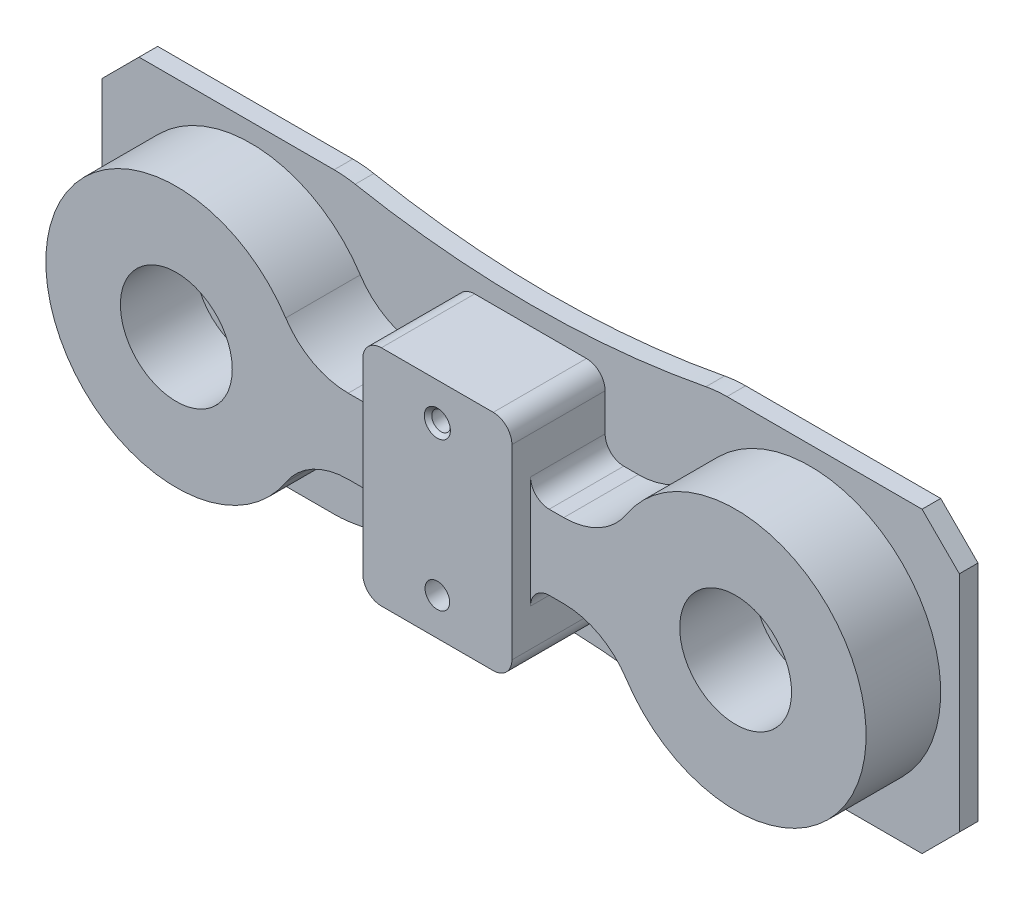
ISO-10303-21;
HEADER;
FILE_DESCRIPTION(('STEP AP214'),'2;1');
FILE_NAME('part.step','',(''),(''),'','','');
FILE_SCHEMA(('AUTOMOTIVE_DESIGN { 1 0 10303 214 1 1 1 1 }'));
ENDSEC;
DATA;
#1=APPLICATION_CONTEXT('core data for automotive mechanical design processes');
#2=APPLICATION_PROTOCOL_DEFINITION('international standard','automotive_design',2000,#1);
#3=PRODUCT_CONTEXT('',#1,'mechanical');
#4=PRODUCT('Part','Part','',(#3));
#5=PRODUCT_RELATED_PRODUCT_CATEGORY('part','',(#4));
#6=PRODUCT_DEFINITION_FORMATION('','',#4);
#7=PRODUCT_DEFINITION_CONTEXT('part definition',#1,'design');
#8=PRODUCT_DEFINITION('design','',#6,#7);
#9=PRODUCT_DEFINITION_SHAPE('','',#8);
#10=(LENGTH_UNIT() NAMED_UNIT(*) SI_UNIT(.MILLI.,.METRE.));
#11=(NAMED_UNIT(*) PLANE_ANGLE_UNIT() SI_UNIT($,.RADIAN.));
#12=(NAMED_UNIT(*) SI_UNIT($,.STERADIAN.) SOLID_ANGLE_UNIT());
#13=UNCERTAINTY_MEASURE_WITH_UNIT(LENGTH_MEASURE(1.E-05),#10,'distance_accuracy_value','');
#14=(GEOMETRIC_REPRESENTATION_CONTEXT(3) GLOBAL_UNCERTAINTY_ASSIGNED_CONTEXT((#13)) GLOBAL_UNIT_ASSIGNED_CONTEXT((#10,
#11,#12)) REPRESENTATION_CONTEXT('',''));
#15=CARTESIAN_POINT('',(0.,0.,0.));
#16=DIRECTION('',(0.,0.,1.));
#17=DIRECTION('',(1.,0.,0.));
#18=AXIS2_PLACEMENT_3D('',#15,#16,#17);
#19=CARTESIAN_POINT('',(-105.,40.,5.));
#20=DIRECTION('',(0.,-1.,0.));
#21=DIRECTION('',(0.,0.,-1.));
#22=AXIS2_PLACEMENT_3D('',#19,#20,#21);
#23=PLANE('',#22);
#24=DIRECTION('',(-1.,0.,0.));
#25=VECTOR('',#24,1.);
#26=CARTESIAN_POINT('',(-105.,40.,0.));
#27=LINE('',#26,#25);
#28=CARTESIAN_POINT('',(105.,40.,0.));
#29=VERTEX_POINT('',#28);
#30=CARTESIAN_POINT('',(52.6782687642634,40.,0.));
#31=VERTEX_POINT('',#30);
#32=EDGE_CURVE('E595',#29,#31,#27,.T.);
#33=ORIENTED_EDGE('',*,*,#32,.T.);
#34=DIRECTION('',(0.,0.,1.));
#35=VECTOR('',#34,1.);
#36=CARTESIAN_POINT('',(52.6782687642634,40.,5.));
#37=LINE('',#36,#35);
#38=CARTESIAN_POINT('',(52.6782687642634,40.,5.));
#39=VERTEX_POINT('',#38);
#40=EDGE_CURVE('E601',#31,#39,#37,.T.);
#41=ORIENTED_EDGE('',*,*,#40,.T.);
#42=DIRECTION('',(-1.,0.,0.));
#43=VECTOR('',#42,1.);
#44=CARTESIAN_POINT('',(-105.,40.,5.));
#45=LINE('',#44,#43);
#46=CARTESIAN_POINT('',(105.,40.,5.));
#47=VERTEX_POINT('',#46);
#48=EDGE_CURVE('E758',#47,#39,#45,.T.);
#49=ORIENTED_EDGE('',*,*,#48,.F.);
#50=DIRECTION('',(0.,0.,-1.));
#51=VECTOR('',#50,1.);
#52=CARTESIAN_POINT('',(105.,40.,5.));
#53=LINE('',#52,#51);
#54=EDGE_CURVE('E1020',#47,#29,#53,.T.);
#55=ORIENTED_EDGE('',*,*,#54,.T.);
#56=EDGE_LOOP('',(#33,#41,#49,#55));
#57=FACE_BOUND('',#56,.T.);
#58=ADVANCED_FACE('F45',(#57),#23,.F.);
#59=CARTESIAN_POINT('',(-105.,-40.,5.));
#60=DIRECTION('',(0.,1.,0.));
#61=DIRECTION('',(0.,0.,1.));
#62=AXIS2_PLACEMENT_3D('',#59,#60,#61);
#63=PLANE('',#62);
#64=DIRECTION('',(1.,0.,0.));
#65=VECTOR('',#64,1.);
#66=CARTESIAN_POINT('',(-105.,-40.,0.));
#67=LINE('',#66,#65);
#68=CARTESIAN_POINT('',(-105.,-40.,0.));
#69=VERTEX_POINT('',#68);
#70=CARTESIAN_POINT('',(-52.6782687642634,-40.,0.));
#71=VERTEX_POINT('',#70);
#72=EDGE_CURVE('E629',#69,#71,#67,.T.);
#73=ORIENTED_EDGE('',*,*,#72,.T.);
#74=DIRECTION('',(0.,0.,1.));
#75=VECTOR('',#74,1.);
#76=CARTESIAN_POINT('',(-52.6782687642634,-40.,5.));
#77=LINE('',#76,#75);
#78=CARTESIAN_POINT('',(-52.6782687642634,-40.,5.));
#79=VERTEX_POINT('',#78);
#80=EDGE_CURVE('E13',#71,#79,#77,.T.);
#81=ORIENTED_EDGE('',*,*,#80,.T.);
#82=DIRECTION('',(1.,0.,0.));
#83=VECTOR('',#82,1.);
#84=CARTESIAN_POINT('',(-105.,-40.,5.));
#85=LINE('',#84,#83);
#86=CARTESIAN_POINT('',(-105.,-40.,5.));
#87=VERTEX_POINT('',#86);
#88=EDGE_CURVE('E808',#87,#79,#85,.T.);
#89=ORIENTED_EDGE('',*,*,#88,.F.);
#90=DIRECTION('',(0.,0.,-1.));
#91=VECTOR('',#90,1.);
#92=CARTESIAN_POINT('',(-105.,-40.,5.));
#93=LINE('',#92,#91);
#94=EDGE_CURVE('E584',#87,#69,#93,.T.);
#95=ORIENTED_EDGE('',*,*,#94,.T.);
#96=EDGE_LOOP('',(#73,#81,#89,#95));
#97=FACE_BOUND('',#96,.T.);
#98=ADVANCED_FACE('F723',(#97),#63,.F.);
#99=CARTESIAN_POINT('',(-115.,40.,5.));
#100=DIRECTION('',(0.,0.,-1.));
#101=DIRECTION('',(-1.,0.,0.));
#102=AXIS2_PLACEMENT_3D('',#99,#100,#101);
#103=PLANE('',#102);
#104=CARTESIAN_POINT('',(0.,285.,5.));
#105=DIRECTION('',(0.,0.,1.));
#106=DIRECTION('',(-1.,0.,0.));
#107=AXIS2_PLACEMENT_3D('',#104,#105,#106);
#108=CIRCLE('',#107,250.);
#109=CARTESIAN_POINT('',(-47.0341685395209,39.4642857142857,5.));
#110=VERTEX_POINT('',#109);
#111=CARTESIAN_POINT('',(47.0341685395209,39.4642857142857,5.));
#112=VERTEX_POINT('',#111);
#113=EDGE_CURVE('E609',#110,#112,#108,.T.);
#114=ORIENTED_EDGE('',*,*,#113,.F.);
#115=CARTESIAN_POINT('',(-52.6782687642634,10.,5.));
#116=DIRECTION('',(0.,0.,-1.));
#117=DIRECTION('',(-1.,0.,0.));
#118=AXIS2_PLACEMENT_3D('',#115,#116,#117);
#119=CIRCLE('',#118,30.);
#120=CARTESIAN_POINT('',(-52.6782687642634,40.,5.));
#121=VERTEX_POINT('',#120);
#122=EDGE_CURVE('E765',#110,#121,#119,.F.);
#123=ORIENTED_EDGE('',*,*,#122,.T.);
#124=CARTESIAN_POINT('',(-105.,40.,5.));
#125=VERTEX_POINT('',#124);
#126=EDGE_CURVE('E753',#121,#125,#45,.T.);
#127=ORIENTED_EDGE('',*,*,#126,.T.);
#128=DIRECTION('',(-0.707106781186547,-0.707106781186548,0.));
#129=VECTOR('',#128,1.);
#130=CARTESIAN_POINT('',(-115.,30.,5.));
#131=LINE('',#130,#129);
#132=CARTESIAN_POINT('',(-115.,30.,5.));
#133=VERTEX_POINT('',#132);
#134=EDGE_CURVE('E590',#125,#133,#131,.T.);
#135=ORIENTED_EDGE('',*,*,#134,.T.);
#136=DIRECTION('',(0.,-1.,0.));
#137=VECTOR('',#136,1.);
#138=CARTESIAN_POINT('',(-115.,-30.,5.));
#139=LINE('',#138,#137);
#140=CARTESIAN_POINT('',(-115.,-30.,5.));
#141=VERTEX_POINT('',#140);
#142=EDGE_CURVE('E654',#133,#141,#139,.T.);
#143=ORIENTED_EDGE('',*,*,#142,.T.);
#144=DIRECTION('',(0.707106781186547,-0.707106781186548,0.));
#145=VECTOR('',#144,1.);
#146=CARTESIAN_POINT('',(-115.,-30.,5.));
#147=LINE('',#146,#145);
#148=EDGE_CURVE('E1039',#141,#87,#147,.T.);
#149=ORIENTED_EDGE('',*,*,#148,.T.);
#150=ORIENTED_EDGE('',*,*,#88,.T.);
#151=CARTESIAN_POINT('',(-52.6782687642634,-10.,5.));
#152=DIRECTION('',(0.,0.,-1.));
#153=DIRECTION('',(-1.,0.,0.));
#154=AXIS2_PLACEMENT_3D('',#151,#152,#153);
#155=CIRCLE('',#154,30.);
#156=CARTESIAN_POINT('',(-47.0341685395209,-39.4642857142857,5.));
#157=VERTEX_POINT('',#156);
#158=EDGE_CURVE('E787',#79,#157,#155,.F.);
#159=ORIENTED_EDGE('',*,*,#158,.T.);
#160=CARTESIAN_POINT('',(0.,-285.,5.));
#161=DIRECTION('',(0.,0.,1.));
#162=DIRECTION('',(1.,0.,0.));
#163=AXIS2_PLACEMENT_3D('',#160,#161,#162);
#164=CIRCLE('',#163,250.);
#165=CARTESIAN_POINT('',(47.0341685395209,-39.4642857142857,5.));
#166=VERTEX_POINT('',#165);
#167=EDGE_CURVE('E608',#166,#157,#164,.T.);
#168=ORIENTED_EDGE('',*,*,#167,.F.);
#169=CARTESIAN_POINT('',(52.6782687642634,-10.,5.));
#170=DIRECTION('',(0.,0.,-1.));
#171=DIRECTION('',(-1.,0.,0.));
#172=AXIS2_PLACEMENT_3D('',#169,#170,#171);
#173=CIRCLE('',#172,30.);
#174=CARTESIAN_POINT('',(52.6782687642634,-40.,5.));
#175=VERTEX_POINT('',#174);
#176=EDGE_CURVE('E784',#166,#175,#173,.F.);
#177=ORIENTED_EDGE('',*,*,#176,.T.);
#178=CARTESIAN_POINT('',(105.,-40.,5.));
#179=VERTEX_POINT('',#178);
#180=EDGE_CURVE('E1057',#175,#179,#85,.T.);
#181=ORIENTED_EDGE('',*,*,#180,.T.);
#182=DIRECTION('',(0.707106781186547,0.707106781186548,0.));
#183=VECTOR('',#182,1.);
#184=CARTESIAN_POINT('',(105.,-40.,5.));
#185=LINE('',#184,#183);
#186=CARTESIAN_POINT('',(115.,-30.,5.));
#187=VERTEX_POINT('',#186);
#188=EDGE_CURVE('E804',#179,#187,#185,.T.);
#189=ORIENTED_EDGE('',*,*,#188,.T.);
#190=DIRECTION('',(0.,1.,0.));
#191=VECTOR('',#190,1.);
#192=CARTESIAN_POINT('',(115.,-30.,5.));
#193=LINE('',#192,#191);
#194=CARTESIAN_POINT('',(115.,30.,5.));
#195=VERTEX_POINT('',#194);
#196=EDGE_CURVE('E807',#187,#195,#193,.T.);
#197=ORIENTED_EDGE('',*,*,#196,.T.);
#198=DIRECTION('',(-0.707106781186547,0.707106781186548,0.));
#199=VECTOR('',#198,1.);
#200=CARTESIAN_POINT('',(105.,40.,5.));
#201=LINE('',#200,#199);
#202=EDGE_CURVE('E759',#195,#47,#201,.T.);
#203=ORIENTED_EDGE('',*,*,#202,.T.);
#204=ORIENTED_EDGE('',*,*,#48,.T.);
#205=CARTESIAN_POINT('',(52.6782687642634,10.,5.));
#206=DIRECTION('',(0.,0.,-1.));
#207=DIRECTION('',(-1.,0.,0.));
#208=AXIS2_PLACEMENT_3D('',#205,#206,#207);
#209=CIRCLE('',#208,30.);
#210=EDGE_CURVE('E769',#39,#112,#209,.F.);
#211=ORIENTED_EDGE('',*,*,#210,.T.);
#212=EDGE_LOOP('',(#114,#123,#127,#135,#143,#149,#150,#159,#168,#177,#181,#189,#197,#203,#204,#211));
#213=FACE_BOUND('',#212,.T.);
#214=DIRECTION('',(-1.,0.,0.));
#215=VECTOR('',#214,1.);
#216=CARTESIAN_POINT('',(-28.9022777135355,10.,5.));
#217=LINE('',#216,#215);
#218=CARTESIAN_POINT('',(-25.,10.,5.));
#219=VERTEX_POINT('',#218);
#220=CARTESIAN_POINT('',(-28.9022777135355,10.,5.));
#221=VERTEX_POINT('',#220);
#222=EDGE_CURVE('E838',#219,#221,#217,.T.);
#223=ORIENTED_EDGE('',*,*,#222,.F.);
#224=CARTESIAN_POINT('',(-25.,15.,5.));
#225=DIRECTION('',(0.,0.,-1.));
#226=DIRECTION('',(-1.,0.,0.));
#227=AXIS2_PLACEMENT_3D('',#224,#225,#226);
#228=CIRCLE('',#227,5.);
#229=CARTESIAN_POINT('',(-20.,15.,5.));
#230=VERTEX_POINT('',#229);
#231=EDGE_CURVE('E381',#219,#230,#228,.F.);
#232=ORIENTED_EDGE('',*,*,#231,.T.);
#233=DIRECTION('',(0.,-1.,0.));
#234=VECTOR('',#233,1.);
#235=CARTESIAN_POINT('',(-20.,-30.,5.));
#236=LINE('',#235,#234);
#237=CARTESIAN_POINT('',(-20.,25.,5.));
#238=VERTEX_POINT('',#237);
#239=EDGE_CURVE('E954',#238,#230,#236,.T.);
#240=ORIENTED_EDGE('',*,*,#239,.F.);
#241=CARTESIAN_POINT('',(-15.,25.,5.));
#242=DIRECTION('',(0.,0.,-1.));
#243=DIRECTION('',(-1.,0.,0.));
#244=AXIS2_PLACEMENT_3D('',#241,#242,#243);
#245=CIRCLE('',#244,5.);
#246=CARTESIAN_POINT('',(-15.,30.,5.));
#247=VERTEX_POINT('',#246);
#248=EDGE_CURVE('E937',#238,#247,#245,.T.);
#249=ORIENTED_EDGE('',*,*,#248,.T.);
#250=DIRECTION('',(-1.,0.,0.));
#251=VECTOR('',#250,1.);
#252=CARTESIAN_POINT('',(-20.,30.,5.));
#253=LINE('',#252,#251);
#254=CARTESIAN_POINT('',(15.,30.,5.));
#255=VERTEX_POINT('',#254);
#256=EDGE_CURVE('E949',#255,#247,#253,.T.);
#257=ORIENTED_EDGE('',*,*,#256,.F.);
#258=CARTESIAN_POINT('',(15.,25.,5.));
#259=DIRECTION('',(0.,0.,-1.));
#260=DIRECTION('',(-1.,0.,0.));
#261=AXIS2_PLACEMENT_3D('',#258,#259,#260);
#262=CIRCLE('',#261,5.);
#263=CARTESIAN_POINT('',(20.,25.,5.));
#264=VERTEX_POINT('',#263);
#265=EDGE_CURVE('E941',#255,#264,#262,.T.);
#266=ORIENTED_EDGE('',*,*,#265,.T.);
#267=DIRECTION('',(0.,1.,0.));
#268=VECTOR('',#267,1.);
#269=CARTESIAN_POINT('',(20.,-30.,5.));
#270=LINE('',#269,#268);
#271=CARTESIAN_POINT('',(20.,15.,5.));
#272=VERTEX_POINT('',#271);
#273=EDGE_CURVE('E325',#272,#264,#270,.T.);
#274=ORIENTED_EDGE('',*,*,#273,.F.);
#275=CARTESIAN_POINT('',(25.,15.,5.));
#276=DIRECTION('',(0.,0.,-1.));
#277=DIRECTION('',(-1.,0.,0.));
#278=AXIS2_PLACEMENT_3D('',#275,#276,#277);
#279=CIRCLE('',#278,5.);
#280=CARTESIAN_POINT('',(25.,10.,5.));
#281=VERTEX_POINT('',#280);
#282=EDGE_CURVE('E976',#272,#281,#279,.F.);
#283=ORIENTED_EDGE('',*,*,#282,.T.);
#284=CARTESIAN_POINT('',(28.9022777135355,10.,5.));
#285=VERTEX_POINT('',#284);
#286=EDGE_CURVE('E450',#285,#281,#217,.T.);
#287=ORIENTED_EDGE('',*,*,#286,.F.);
#288=CARTESIAN_POINT('',(28.9022777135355,30.,5.));
#289=DIRECTION('',(0.,0.,-1.));
#290=DIRECTION('',(-1.,0.,0.));
#291=AXIS2_PLACEMENT_3D('',#288,#289,#290);
#292=CIRCLE('',#291,20.);
#293=CARTESIAN_POINT('',(45.6650858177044,19.0909090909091,5.));
#294=VERTEX_POINT('',#293);
#295=EDGE_CURVE('E830',#294,#285,#292,.T.);
#296=ORIENTED_EDGE('',*,*,#295,.F.);
#297=CARTESIAN_POINT('',(75.,0.,5.));
#298=DIRECTION('',(0.,0.,1.));
#299=DIRECTION('',(1.,0.,0.));
#300=AXIS2_PLACEMENT_3D('',#297,#298,#299);
#301=CIRCLE('',#300,35.);
#302=CARTESIAN_POINT('',(45.6650858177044,-19.0909090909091,5.));
#303=VERTEX_POINT('',#302);
#304=EDGE_CURVE('E824',#303,#294,#301,.T.);
#305=ORIENTED_EDGE('',*,*,#304,.F.);
#306=CARTESIAN_POINT('',(28.9022777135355,-30.,5.));
#307=DIRECTION('',(0.,0.,-1.));
#308=DIRECTION('',(1.,0.,0.));
#309=AXIS2_PLACEMENT_3D('',#306,#307,#308);
#310=CIRCLE('',#309,20.);
#311=CARTESIAN_POINT('',(28.9022777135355,-9.99999999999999,5.));
#312=VERTEX_POINT('',#311);
#313=EDGE_CURVE('E831',#312,#303,#310,.T.);
#314=ORIENTED_EDGE('',*,*,#313,.F.);
#315=DIRECTION('',(1.,0.,0.));
#316=VECTOR('',#315,1.);
#317=CARTESIAN_POINT('',(-28.9022777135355,-10.,5.));
#318=LINE('',#317,#316);
#319=CARTESIAN_POINT('',(25.,-10.,5.));
#320=VERTEX_POINT('',#319);
#321=EDGE_CURVE('E853',#320,#312,#318,.T.);
#322=ORIENTED_EDGE('',*,*,#321,.F.);
#323=CARTESIAN_POINT('',(25.,-15.,5.));
#324=DIRECTION('',(0.,0.,-1.));
#325=DIRECTION('',(-1.,0.,0.));
#326=AXIS2_PLACEMENT_3D('',#323,#324,#325);
#327=CIRCLE('',#326,5.);
#328=CARTESIAN_POINT('',(20.,-15.,5.));
#329=VERTEX_POINT('',#328);
#330=EDGE_CURVE('E971',#320,#329,#327,.F.);
#331=ORIENTED_EDGE('',*,*,#330,.T.);
#332=CARTESIAN_POINT('',(20.,-25.,5.));
#333=VERTEX_POINT('',#332);
#334=EDGE_CURVE('E333',#333,#329,#270,.T.);
#335=ORIENTED_EDGE('',*,*,#334,.F.);
#336=CARTESIAN_POINT('',(15.,-25.,5.));
#337=DIRECTION('',(0.,0.,-1.));
#338=DIRECTION('',(-1.,0.,0.));
#339=AXIS2_PLACEMENT_3D('',#336,#337,#338);
#340=CIRCLE('',#339,5.);
#341=CARTESIAN_POINT('',(15.,-30.,5.));
#342=VERTEX_POINT('',#341);
#343=EDGE_CURVE('E984',#333,#342,#340,.T.);
#344=ORIENTED_EDGE('',*,*,#343,.T.);
#345=DIRECTION('',(1.,0.,0.));
#346=VECTOR('',#345,1.);
#347=CARTESIAN_POINT('',(-20.,-30.,5.));
#348=LINE('',#347,#346);
#349=CARTESIAN_POINT('',(-15.,-30.,5.));
#350=VERTEX_POINT('',#349);
#351=EDGE_CURVE('E341',#350,#342,#348,.T.);
#352=ORIENTED_EDGE('',*,*,#351,.F.);
#353=CARTESIAN_POINT('',(-15.,-25.,5.));
#354=DIRECTION('',(0.,0.,-1.));
#355=DIRECTION('',(-1.,0.,0.));
#356=AXIS2_PLACEMENT_3D('',#353,#354,#355);
#357=CIRCLE('',#356,5.);
#358=CARTESIAN_POINT('',(-20.,-25.,5.));
#359=VERTEX_POINT('',#358);
#360=EDGE_CURVE('E981',#350,#359,#357,.T.);
#361=ORIENTED_EDGE('',*,*,#360,.T.);
#362=CARTESIAN_POINT('',(-20.,-15.,5.));
#363=VERTEX_POINT('',#362);
#364=EDGE_CURVE('E953',#363,#359,#236,.T.);
#365=ORIENTED_EDGE('',*,*,#364,.F.);
#366=CARTESIAN_POINT('',(-25.,-15.,5.));
#367=DIRECTION('',(0.,0.,-1.));
#368=DIRECTION('',(-1.,0.,0.));
#369=AXIS2_PLACEMENT_3D('',#366,#367,#368);
#370=CIRCLE('',#369,5.);
#371=CARTESIAN_POINT('',(-25.,-10.,5.));
#372=VERTEX_POINT('',#371);
#373=EDGE_CURVE('E1663',#363,#372,#370,.F.);
#374=ORIENTED_EDGE('',*,*,#373,.T.);
#375=CARTESIAN_POINT('',(-28.9022777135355,-10.,5.));
#376=VERTEX_POINT('',#375);
#377=EDGE_CURVE('E848',#376,#372,#318,.T.);
#378=ORIENTED_EDGE('',*,*,#377,.F.);
#379=CARTESIAN_POINT('',(-28.9022777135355,-30.,5.));
#380=DIRECTION('',(0.,0.,-1.));
#381=DIRECTION('',(-1.,0.,0.));
#382=AXIS2_PLACEMENT_3D('',#379,#380,#381);
#383=CIRCLE('',#382,20.);
#384=CARTESIAN_POINT('',(-45.6650858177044,-19.0909090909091,5.));
#385=VERTEX_POINT('',#384);
#386=EDGE_CURVE('E854',#385,#376,#383,.T.);
#387=ORIENTED_EDGE('',*,*,#386,.F.);
#388=CARTESIAN_POINT('',(-75.,0.,5.));
#389=DIRECTION('',(0.,0.,1.));
#390=DIRECTION('',(-1.,0.,0.));
#391=AXIS2_PLACEMENT_3D('',#388,#389,#390);
#392=CIRCLE('',#391,35.);
#393=CARTESIAN_POINT('',(-45.6650858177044,19.0909090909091,5.));
#394=VERTEX_POINT('',#393);
#395=EDGE_CURVE('E865',#394,#385,#392,.T.);
#396=ORIENTED_EDGE('',*,*,#395,.F.);
#397=CARTESIAN_POINT('',(-28.9022777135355,30.,5.));
#398=DIRECTION('',(0.,0.,-1.));
#399=DIRECTION('',(1.,0.,0.));
#400=AXIS2_PLACEMENT_3D('',#397,#398,#399);
#401=CIRCLE('',#400,20.);
#402=EDGE_CURVE('E443',#221,#394,#401,.T.);
#403=ORIENTED_EDGE('',*,*,#402,.F.);
#404=EDGE_LOOP('',(#223,#232,#240,#249,#257,#266,#274,#283,#287,#296,#305,#314,#322,#331,#335,
#344,#352,#361,#365,#374,#378,#387,#396,#403));
#405=FACE_BOUND('',#404,.T.);
#406=ADVANCED_FACE('F716',(#213,#405),#103,.F.);
#407=CARTESIAN_POINT('',(-28.9022777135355,-10.,25.));
#408=DIRECTION('',(0.,1.,0.));
#409=DIRECTION('',(0.,0.,1.));
#410=AXIS2_PLACEMENT_3D('',#407,#408,#409);
#411=PLANE('',#410);
#412=DIRECTION('',(1.,0.,0.));
#413=VECTOR('',#412,1.);
#414=CARTESIAN_POINT('',(-28.9022777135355,-10.,25.));
#415=LINE('',#414,#413);
#416=CARTESIAN_POINT('',(25.,-10.,25.));
#417=VERTEX_POINT('',#416);
#418=CARTESIAN_POINT('',(28.9022777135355,-10.,25.));
#419=VERTEX_POINT('',#418);
#420=EDGE_CURVE('E465',#417,#419,#415,.T.);
#421=ORIENTED_EDGE('',*,*,#420,.F.);
#422=DIRECTION('',(0.,0.,1.));
#423=VECTOR('',#422,1.);
#424=CARTESIAN_POINT('',(25.,-10.,5.));
#425=LINE('',#424,#423);
#426=EDGE_CURVE('E395',#417,#320,#425,.F.);
#427=ORIENTED_EDGE('',*,*,#426,.T.);
#428=ORIENTED_EDGE('',*,*,#321,.T.);
#429=DIRECTION('',(0.,0.,-1.));
#430=VECTOR('',#429,1.);
#431=CARTESIAN_POINT('',(28.9022777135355,-10.,25.));
#432=LINE('',#431,#430);
#433=EDGE_CURVE('E906',#419,#312,#432,.T.);
#434=ORIENTED_EDGE('',*,*,#433,.F.);
#435=EDGE_LOOP('',(#421,#427,#428,#434));
#436=FACE_BOUND('',#435,.T.);
#437=ADVANCED_FACE('F711',(#436),#411,.F.);
#438=ORIENTED_EDGE('',*,*,#377,.T.);
#439=DIRECTION('',(0.,0.,-1.));
#440=VECTOR('',#439,1.);
#441=CARTESIAN_POINT('',(-25.,-10.,25.));
#442=LINE('',#441,#440);
#443=CARTESIAN_POINT('',(-25.,-10.,25.));
#444=VERTEX_POINT('',#443);
#445=EDGE_CURVE('E397',#372,#444,#442,.F.);
#446=ORIENTED_EDGE('',*,*,#445,.T.);
#447=CARTESIAN_POINT('',(-28.9022777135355,-9.99999999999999,25.));
#448=VERTEX_POINT('',#447);
#449=EDGE_CURVE('E466',#448,#444,#415,.T.);
#450=ORIENTED_EDGE('',*,*,#449,.F.);
#451=DIRECTION('',(0.,0.,-1.));
#452=VECTOR('',#451,1.);
#453=CARTESIAN_POINT('',(-28.9022777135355,-9.99999999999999,25.));
#454=LINE('',#453,#452);
#455=EDGE_CURVE('E1671',#448,#376,#454,.T.);
#456=ORIENTED_EDGE('',*,*,#455,.T.);
#457=EDGE_LOOP('',(#438,#446,#450,#456));
#458=FACE_BOUND('',#457,.T.);
#459=ADVANCED_FACE('F715',(#458),#411,.F.);
#460=CARTESIAN_POINT('',(-28.9022777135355,10.,25.));
#461=DIRECTION('',(0.,-1.,0.));
#462=DIRECTION('',(0.,0.,-1.));
#463=AXIS2_PLACEMENT_3D('',#460,#461,#462);
#464=PLANE('',#463);
#465=ORIENTED_EDGE('',*,*,#286,.T.);
#466=DIRECTION('',(0.,0.,-1.));
#467=VECTOR('',#466,1.);
#468=CARTESIAN_POINT('',(25.,10.,25.));
#469=LINE('',#468,#467);
#470=CARTESIAN_POINT('',(25.,10.,25.));
#471=VERTEX_POINT('',#470);
#472=EDGE_CURVE('E393',#281,#471,#469,.F.);
#473=ORIENTED_EDGE('',*,*,#472,.T.);
#474=DIRECTION('',(-1.,0.,0.));
#475=VECTOR('',#474,1.);
#476=CARTESIAN_POINT('',(-28.9022777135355,10.,25.));
#477=LINE('',#476,#475);
#478=CARTESIAN_POINT('',(28.9022777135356,9.99999999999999,25.));
#479=VERTEX_POINT('',#478);
#480=EDGE_CURVE('E872',#479,#471,#477,.T.);
#481=ORIENTED_EDGE('',*,*,#480,.F.);
#482=DIRECTION('',(0.,0.,-1.));
#483=VECTOR('',#482,1.);
#484=CARTESIAN_POINT('',(28.9022777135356,9.99999999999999,25.));
#485=LINE('',#484,#483);
#486=EDGE_CURVE('E914',#479,#285,#485,.T.);
#487=ORIENTED_EDGE('',*,*,#486,.T.);
#488=EDGE_LOOP('',(#465,#473,#481,#487));
#489=FACE_BOUND('',#488,.T.);
#490=ADVANCED_FACE('F563',(#489),#464,.F.);
#491=CARTESIAN_POINT('',(-25.,10.,25.));
#492=VERTEX_POINT('',#491);
#493=CARTESIAN_POINT('',(-28.9022777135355,10.,25.));
#494=VERTEX_POINT('',#493);
#495=EDGE_CURVE('E877',#492,#494,#477,.T.);
#496=ORIENTED_EDGE('',*,*,#495,.F.);
#497=DIRECTION('',(0.,0.,1.));
#498=VECTOR('',#497,1.);
#499=CARTESIAN_POINT('',(-25.,10.,5.));
#500=LINE('',#499,#498);
#501=EDGE_CURVE('E1666',#492,#219,#500,.F.);
#502=ORIENTED_EDGE('',*,*,#501,.T.);
#503=ORIENTED_EDGE('',*,*,#222,.T.);
#504=DIRECTION('',(0.,0.,-1.));
#505=VECTOR('',#504,1.);
#506=CARTESIAN_POINT('',(-28.9022777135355,10.,25.));
#507=LINE('',#506,#505);
#508=EDGE_CURVE('E876',#494,#221,#507,.T.);
#509=ORIENTED_EDGE('',*,*,#508,.F.);
#510=EDGE_LOOP('',(#496,#502,#503,#509));
#511=FACE_BOUND('',#510,.T.);
#512=ADVANCED_FACE('F1163',(#511),#464,.F.);
#513=CARTESIAN_POINT('',(-28.9022777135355,30.,25.));
#514=DIRECTION('',(0.,0.,1.));
#515=DIRECTION('',(1.,0.,0.));
#516=AXIS2_PLACEMENT_3D('',#513,#514,#515);
#517=PLANE('',#516);
#518=CARTESIAN_POINT('',(75.,0.,25.));
#519=DIRECTION('',(0.,0.,1.));
#520=DIRECTION('',(1.,0.,0.));
#521=AXIS2_PLACEMENT_3D('',#518,#519,#520);
#522=CIRCLE('',#521,15.);
#523=CARTESIAN_POINT('',(90.,0.,25.));
#524=VERTEX_POINT('',#523);
#525=EDGE_CURVE('E504',#524,#524,#522,.T.);
#526=ORIENTED_EDGE('',*,*,#525,.F.);
#527=EDGE_LOOP('',(#526));
#528=FACE_BOUND('',#527,.T.);
#529=ORIENTED_EDGE('',*,*,#480,.T.);
#530=CARTESIAN_POINT('',(25.,15.,25.));
#531=DIRECTION('',(0.,0.,1.));
#532=DIRECTION('',(1.,0.,0.));
#533=AXIS2_PLACEMENT_3D('',#530,#531,#532);
#534=CIRCLE('',#533,5.);
#535=CARTESIAN_POINT('',(20.,15.,25.));
#536=VERTEX_POINT('',#535);
#537=EDGE_CURVE('E920',#471,#536,#534,.F.);
#538=ORIENTED_EDGE('',*,*,#537,.T.);
#539=DIRECTION('',(0.,-1.,0.));
#540=VECTOR('',#539,1.);
#541=CARTESIAN_POINT('',(20.,30.,25.));
#542=LINE('',#541,#540);
#543=CARTESIAN_POINT('',(20.,-15.,25.));
#544=VERTEX_POINT('',#543);
#545=EDGE_CURVE('E479',#536,#544,#542,.T.);
#546=ORIENTED_EDGE('',*,*,#545,.T.);
#547=CARTESIAN_POINT('',(25.,-15.,25.));
#548=DIRECTION('',(0.,0.,1.));
#549=DIRECTION('',(1.,0.,0.));
#550=AXIS2_PLACEMENT_3D('',#547,#548,#549);
#551=CIRCLE('',#550,5.);
#552=EDGE_CURVE('E924',#544,#417,#551,.F.);
#553=ORIENTED_EDGE('',*,*,#552,.T.);
#554=ORIENTED_EDGE('',*,*,#420,.T.);
#555=CARTESIAN_POINT('',(28.9022777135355,-30.,25.));
#556=DIRECTION('',(0.,0.,-1.));
#557=DIRECTION('',(1.,0.,0.));
#558=AXIS2_PLACEMENT_3D('',#555,#556,#557);
#559=CIRCLE('',#558,20.);
#560=CARTESIAN_POINT('',(45.6650858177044,-19.0909090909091,25.));
#561=VERTEX_POINT('',#560);
#562=EDGE_CURVE('E471',#419,#561,#559,.T.);
#563=ORIENTED_EDGE('',*,*,#562,.T.);
#564=CARTESIAN_POINT('',(75.,0.,25.));
#565=DIRECTION('',(0.,0.,1.));
#566=DIRECTION('',(1.,0.,0.));
#567=AXIS2_PLACEMENT_3D('',#564,#565,#566);
#568=CIRCLE('',#567,35.);
#569=CARTESIAN_POINT('',(45.6650858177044,19.0909090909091,25.));
#570=VERTEX_POINT('',#569);
#571=EDGE_CURVE('E882',#561,#570,#568,.T.);
#572=ORIENTED_EDGE('',*,*,#571,.T.);
#573=CARTESIAN_POINT('',(28.9022777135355,30.,25.));
#574=DIRECTION('',(0.,0.,-1.));
#575=DIRECTION('',(-1.,0.,0.));
#576=AXIS2_PLACEMENT_3D('',#573,#574,#575);
#577=CIRCLE('',#576,20.);
#578=EDGE_CURVE('E878',#570,#479,#577,.T.);
#579=ORIENTED_EDGE('',*,*,#578,.T.);
#580=EDGE_LOOP('',(#529,#538,#546,#553,#554,#563,#572,#579));
#581=FACE_BOUND('',#580,.T.);
#582=ADVANCED_FACE('F897',(#528,#581),#517,.T.);
#583=CARTESIAN_POINT('',(-75.,0.,25.));
#584=DIRECTION('',(0.,0.,1.));
#585=DIRECTION('',(1.,0.,0.));
#586=AXIS2_PLACEMENT_3D('',#583,#584,#585);
#587=CIRCLE('',#586,15.);
#588=CARTESIAN_POINT('',(-60.,0.,25.));
#589=VERTEX_POINT('',#588);
#590=EDGE_CURVE('E432',#589,#589,#587,.T.);
#591=ORIENTED_EDGE('',*,*,#590,.F.);
#592=EDGE_LOOP('',(#591));
#593=FACE_BOUND('',#592,.T.);
#594=ORIENTED_EDGE('',*,*,#449,.T.);
#595=CARTESIAN_POINT('',(-25.,-15.,25.));
#596=DIRECTION('',(0.,0.,1.));
#597=DIRECTION('',(1.,0.,0.));
#598=AXIS2_PLACEMENT_3D('',#595,#596,#597);
#599=CIRCLE('',#598,5.);
#600=CARTESIAN_POINT('',(-20.,-15.,25.));
#601=VERTEX_POINT('',#600);
#602=EDGE_CURVE('E929',#444,#601,#599,.F.);
#603=ORIENTED_EDGE('',*,*,#602,.T.);
#604=DIRECTION('',(0.,1.,0.));
#605=VECTOR('',#604,1.);
#606=CARTESIAN_POINT('',(-20.,30.,25.));
#607=LINE('',#606,#605);
#608=CARTESIAN_POINT('',(-20.,15.,25.));
#609=VERTEX_POINT('',#608);
#610=EDGE_CURVE('E485',#601,#609,#607,.T.);
#611=ORIENTED_EDGE('',*,*,#610,.T.);
#612=CARTESIAN_POINT('',(-25.,15.,25.));
#613=DIRECTION('',(0.,0.,1.));
#614=DIRECTION('',(1.,0.,0.));
#615=AXIS2_PLACEMENT_3D('',#612,#613,#614);
#616=CIRCLE('',#615,5.);
#617=EDGE_CURVE('E925',#609,#492,#616,.F.);
#618=ORIENTED_EDGE('',*,*,#617,.T.);
#619=ORIENTED_EDGE('',*,*,#495,.T.);
#620=CARTESIAN_POINT('',(-28.9022777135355,30.,25.));
#621=DIRECTION('',(0.,0.,-1.));
#622=DIRECTION('',(1.,0.,0.));
#623=AXIS2_PLACEMENT_3D('',#620,#621,#622);
#624=CIRCLE('',#623,20.);
#625=CARTESIAN_POINT('',(-45.6650858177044,19.0909090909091,25.));
#626=VERTEX_POINT('',#625);
#627=EDGE_CURVE('E444',#494,#626,#624,.T.);
#628=ORIENTED_EDGE('',*,*,#627,.T.);
#629=CARTESIAN_POINT('',(-75.,0.,25.));
#630=DIRECTION('',(0.,0.,1.));
#631=DIRECTION('',(-1.,0.,0.));
#632=AXIS2_PLACEMENT_3D('',#629,#630,#631);
#633=CIRCLE('',#632,35.);
#634=CARTESIAN_POINT('',(-45.6650858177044,-19.0909090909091,25.));
#635=VERTEX_POINT('',#634);
#636=EDGE_CURVE('E449',#626,#635,#633,.T.);
#637=ORIENTED_EDGE('',*,*,#636,.T.);
#638=CARTESIAN_POINT('',(-28.9022777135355,-30.,25.));
#639=DIRECTION('',(0.,0.,-1.));
#640=DIRECTION('',(-1.,0.,0.));
#641=AXIS2_PLACEMENT_3D('',#638,#639,#640);
#642=CIRCLE('',#641,20.);
#643=EDGE_CURVE('E461',#635,#448,#642,.T.);
#644=ORIENTED_EDGE('',*,*,#643,.T.);
#645=EDGE_LOOP('',(#594,#603,#611,#618,#619,#628,#637,#644));
#646=FACE_BOUND('',#645,.T.);
#647=ADVANCED_FACE('F1117',(#593,#646),#517,.T.);
#648=CARTESIAN_POINT('',(-115.,-30.,5.));
#649=DIRECTION('',(1.,0.,0.));
#650=DIRECTION('',(0.,0.,-1.));
#651=AXIS2_PLACEMENT_3D('',#648,#649,#650);
#652=PLANE('',#651);
#653=DIRECTION('',(0.,-1.,0.));
#654=VECTOR('',#653,1.);
#655=CARTESIAN_POINT('',(-115.,-30.,0.));
#656=LINE('',#655,#654);
#657=CARTESIAN_POINT('',(-115.,30.,0.));
#658=VERTEX_POINT('',#657);
#659=CARTESIAN_POINT('',(-115.,-30.,0.));
#660=VERTEX_POINT('',#659);
#661=EDGE_CURVE('E564',#658,#660,#656,.T.);
#662=ORIENTED_EDGE('',*,*,#661,.T.);
#663=DIRECTION('',(0.,0.,-1.));
#664=VECTOR('',#663,1.);
#665=CARTESIAN_POINT('',(-115.,-30.,5.));
#666=LINE('',#665,#664);
#667=EDGE_CURVE('E580',#141,#660,#666,.T.);
#668=ORIENTED_EDGE('',*,*,#667,.F.);
#669=ORIENTED_EDGE('',*,*,#142,.F.);
#670=DIRECTION('',(0.,0.,-1.));
#671=VECTOR('',#670,1.);
#672=CARTESIAN_POINT('',(-115.,30.,5.));
#673=LINE('',#672,#671);
#674=EDGE_CURVE('E585',#133,#658,#673,.T.);
#675=ORIENTED_EDGE('',*,*,#674,.T.);
#676=EDGE_LOOP('',(#662,#668,#669,#675));
#677=FACE_BOUND('',#676,.T.);
#678=ADVANCED_FACE('F574',(#677),#652,.F.);
#679=CARTESIAN_POINT('',(-115.,-30.,5.));
#680=DIRECTION('',(0.707106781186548,0.707106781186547,0.));
#681=DIRECTION('',(-0.707106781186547,0.707106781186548,0.));
#682=AXIS2_PLACEMENT_3D('',#679,#680,#681);
#683=PLANE('',#682);
#684=DIRECTION('',(0.707106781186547,-0.707106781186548,0.));
#685=VECTOR('',#684,1.);
#686=CARTESIAN_POINT('',(-115.,-30.,0.));
#687=LINE('',#686,#685);
#688=EDGE_CURVE('E568',#660,#69,#687,.T.);
#689=ORIENTED_EDGE('',*,*,#688,.T.);
#690=ORIENTED_EDGE('',*,*,#94,.F.);
#691=ORIENTED_EDGE('',*,*,#148,.F.);
#692=ORIENTED_EDGE('',*,*,#667,.T.);
#693=EDGE_LOOP('',(#689,#690,#691,#692));
#694=FACE_BOUND('',#693,.T.);
#695=ADVANCED_FACE('F1038',(#694),#683,.F.);
#696=ORIENTED_EDGE('',*,*,#180,.F.);
#697=DIRECTION('',(0.,0.,1.));
#698=VECTOR('',#697,1.);
#699=CARTESIAN_POINT('',(52.6782687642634,-40.,5.));
#700=LINE('',#699,#698);
#701=CARTESIAN_POINT('',(52.6782687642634,-40.,0.));
#702=VERTEX_POINT('',#701);
#703=EDGE_CURVE('E53',#175,#702,#700,.F.);
#704=ORIENTED_EDGE('',*,*,#703,.T.);
#705=CARTESIAN_POINT('',(105.,-40.,0.));
#706=VERTEX_POINT('',#705);
#707=EDGE_CURVE('E631',#702,#706,#67,.T.);
#708=ORIENTED_EDGE('',*,*,#707,.T.);
#709=DIRECTION('',(0.,0.,-1.));
#710=VECTOR('',#709,1.);
#711=CARTESIAN_POINT('',(105.,-40.,5.));
#712=LINE('',#711,#710);
#713=EDGE_CURVE('E702',#179,#706,#712,.T.);
#714=ORIENTED_EDGE('',*,*,#713,.F.);
#715=EDGE_LOOP('',(#696,#704,#708,#714));
#716=FACE_BOUND('',#715,.T.);
#717=ADVANCED_FACE('F737',(#716),#63,.F.);
#718=CARTESIAN_POINT('',(105.,-40.,5.));
#719=DIRECTION('',(-0.707106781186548,0.707106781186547,0.));
#720=DIRECTION('',(-0.707106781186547,-0.707106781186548,0.));
#721=AXIS2_PLACEMENT_3D('',#718,#719,#720);
#722=PLANE('',#721);
#723=DIRECTION('',(0.707106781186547,0.707106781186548,0.));
#724=VECTOR('',#723,1.);
#725=CARTESIAN_POINT('',(105.,-40.,0.));
#726=LINE('',#725,#724);
#727=CARTESIAN_POINT('',(115.,-30.,0.));
#728=VERTEX_POINT('',#727);
#729=EDGE_CURVE('E625',#706,#728,#726,.T.);
#730=ORIENTED_EDGE('',*,*,#729,.T.);
#731=DIRECTION('',(0.,0.,-1.));
#732=VECTOR('',#731,1.);
#733=CARTESIAN_POINT('',(115.,-30.,5.));
#734=LINE('',#733,#732);
#735=EDGE_CURVE('E706',#187,#728,#734,.T.);
#736=ORIENTED_EDGE('',*,*,#735,.F.);
#737=ORIENTED_EDGE('',*,*,#188,.F.);
#738=ORIENTED_EDGE('',*,*,#713,.T.);
#739=EDGE_LOOP('',(#730,#736,#737,#738));
#740=FACE_BOUND('',#739,.T.);
#741=ADVANCED_FACE('F1074',(#740),#722,.F.);
#742=CARTESIAN_POINT('',(115.,-30.,5.));
#743=DIRECTION('',(-1.,0.,0.));
#744=DIRECTION('',(0.,0.,1.));
#745=AXIS2_PLACEMENT_3D('',#742,#743,#744);
#746=PLANE('',#745);
#747=DIRECTION('',(0.,1.,0.));
#748=VECTOR('',#747,1.);
#749=CARTESIAN_POINT('',(115.,-30.,0.));
#750=LINE('',#749,#748);
#751=CARTESIAN_POINT('',(115.,30.,0.));
#752=VERTEX_POINT('',#751);
#753=EDGE_CURVE('E621',#728,#752,#750,.T.);
#754=ORIENTED_EDGE('',*,*,#753,.T.);
#755=DIRECTION('',(0.,0.,-1.));
#756=VECTOR('',#755,1.);
#757=CARTESIAN_POINT('',(115.,30.,5.));
#758=LINE('',#757,#756);
#759=EDGE_CURVE('E1022',#195,#752,#758,.T.);
#760=ORIENTED_EDGE('',*,*,#759,.F.);
#761=ORIENTED_EDGE('',*,*,#196,.F.);
#762=ORIENTED_EDGE('',*,*,#735,.T.);
#763=EDGE_LOOP('',(#754,#760,#761,#762));
#764=FACE_BOUND('',#763,.T.);
#765=ADVANCED_FACE('F749',(#764),#746,.F.);
#766=CARTESIAN_POINT('',(105.,40.,5.));
#767=DIRECTION('',(-0.707106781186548,-0.707106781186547,0.));
#768=DIRECTION('',(0.707106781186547,-0.707106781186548,0.));
#769=AXIS2_PLACEMENT_3D('',#766,#767,#768);
#770=PLANE('',#769);
#771=DIRECTION('',(-0.707106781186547,0.707106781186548,0.));
#772=VECTOR('',#771,1.);
#773=CARTESIAN_POINT('',(105.,40.,0.));
#774=LINE('',#773,#772);
#775=EDGE_CURVE('E596',#752,#29,#774,.T.);
#776=ORIENTED_EDGE('',*,*,#775,.T.);
#777=ORIENTED_EDGE('',*,*,#54,.F.);
#778=ORIENTED_EDGE('',*,*,#202,.F.);
#779=ORIENTED_EDGE('',*,*,#759,.T.);
#780=EDGE_LOOP('',(#776,#777,#778,#779));
#781=FACE_BOUND('',#780,.T.);
#782=ADVANCED_FACE('F742',(#781),#770,.F.);
#783=ORIENTED_EDGE('',*,*,#126,.F.);
#784=DIRECTION('',(0.,0.,1.));
#785=VECTOR('',#784,1.);
#786=CARTESIAN_POINT('',(-52.6782687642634,40.,5.));
#787=LINE('',#786,#785);
#788=CARTESIAN_POINT('',(-52.6782687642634,40.,0.));
#789=VERTEX_POINT('',#788);
#790=EDGE_CURVE('E645',#121,#789,#787,.F.);
#791=ORIENTED_EDGE('',*,*,#790,.T.);
#792=CARTESIAN_POINT('',(-105.,40.,0.));
#793=VERTEX_POINT('',#792);
#794=EDGE_CURVE('E592',#789,#793,#27,.T.);
#795=ORIENTED_EDGE('',*,*,#794,.T.);
#796=DIRECTION('',(0.,0.,-1.));
#797=VECTOR('',#796,1.);
#798=CARTESIAN_POINT('',(-105.,40.,5.));
#799=LINE('',#798,#797);
#800=EDGE_CURVE('E589',#125,#793,#799,.T.);
#801=ORIENTED_EDGE('',*,*,#800,.F.);
#802=EDGE_LOOP('',(#783,#791,#795,#801));
#803=FACE_BOUND('',#802,.T.);
#804=ADVANCED_FACE('F731',(#803),#23,.F.);
#805=CARTESIAN_POINT('',(-115.,30.,5.));
#806=DIRECTION('',(0.707106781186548,-0.707106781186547,0.));
#807=DIRECTION('',(0.707106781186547,0.707106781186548,0.));
#808=AXIS2_PLACEMENT_3D('',#805,#806,#807);
#809=PLANE('',#808);
#810=DIRECTION('',(-0.707106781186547,-0.707106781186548,0.));
#811=VECTOR('',#810,1.);
#812=CARTESIAN_POINT('',(-115.,30.,0.));
#813=LINE('',#812,#811);
#814=EDGE_CURVE('E618',#793,#658,#813,.T.);
#815=ORIENTED_EDGE('',*,*,#814,.T.);
#816=ORIENTED_EDGE('',*,*,#674,.F.);
#817=ORIENTED_EDGE('',*,*,#134,.F.);
#818=ORIENTED_EDGE('',*,*,#800,.T.);
#819=EDGE_LOOP('',(#815,#816,#817,#818));
#820=FACE_BOUND('',#819,.T.);
#821=ADVANCED_FACE('F741',(#820),#809,.F.);
#822=CARTESIAN_POINT('',(-115.,40.,0.));
#823=DIRECTION('',(0.,0.,-1.));
#824=DIRECTION('',(-1.,0.,0.));
#825=AXIS2_PLACEMENT_3D('',#822,#823,#824);
#826=PLANE('',#825);
#827=ORIENTED_EDGE('',*,*,#794,.F.);
#828=CARTESIAN_POINT('',(-52.6782687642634,10.,0.));
#829=DIRECTION('',(0.,0.,-1.));
#830=DIRECTION('',(-1.,0.,0.));
#831=AXIS2_PLACEMENT_3D('',#828,#829,#830);
#832=CIRCLE('',#831,30.);
#833=CARTESIAN_POINT('',(-47.0341685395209,39.4642857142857,0.));
#834=VERTEX_POINT('',#833);
#835=EDGE_CURVE('E598',#789,#834,#832,.T.);
#836=ORIENTED_EDGE('',*,*,#835,.T.);
#837=CARTESIAN_POINT('',(0.,285.,0.));
#838=DIRECTION('',(0.,0.,1.));
#839=DIRECTION('',(-1.,0.,0.));
#840=AXIS2_PLACEMENT_3D('',#837,#838,#839);
#841=CIRCLE('',#840,250.);
#842=CARTESIAN_POINT('',(47.0341685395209,39.4642857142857,0.));
#843=VERTEX_POINT('',#842);
#844=EDGE_CURVE('E604',#834,#843,#841,.T.);
#845=ORIENTED_EDGE('',*,*,#844,.T.);
#846=CARTESIAN_POINT('',(52.6782687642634,10.,0.));
#847=DIRECTION('',(0.,0.,-1.));
#848=DIRECTION('',(-1.,0.,0.));
#849=AXIS2_PLACEMENT_3D('',#846,#847,#848);
#850=CIRCLE('',#849,30.);
#851=EDGE_CURVE('E602',#843,#31,#850,.T.);
#852=ORIENTED_EDGE('',*,*,#851,.T.);
#853=ORIENTED_EDGE('',*,*,#32,.F.);
#854=ORIENTED_EDGE('',*,*,#775,.F.);
#855=ORIENTED_EDGE('',*,*,#753,.F.);
#856=ORIENTED_EDGE('',*,*,#729,.F.);
#857=ORIENTED_EDGE('',*,*,#707,.F.);
#858=CARTESIAN_POINT('',(52.6782687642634,-10.,0.));
#859=DIRECTION('',(0.,0.,-1.));
#860=DIRECTION('',(-1.,0.,0.));
#861=AXIS2_PLACEMENT_3D('',#858,#859,#860);
#862=CIRCLE('',#861,30.);
#863=CARTESIAN_POINT('',(47.0341685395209,-39.4642857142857,0.));
#864=VERTEX_POINT('',#863);
#865=EDGE_CURVE('E613',#702,#864,#862,.T.);
#866=ORIENTED_EDGE('',*,*,#865,.T.);
#867=CARTESIAN_POINT('',(0.,-285.,0.));
#868=DIRECTION('',(0.,0.,1.));
#869=DIRECTION('',(1.,0.,0.));
#870=AXIS2_PLACEMENT_3D('',#867,#868,#869);
#871=CIRCLE('',#870,250.);
#872=CARTESIAN_POINT('',(-47.0341685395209,-39.4642857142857,0.));
#873=VERTEX_POINT('',#872);
#874=EDGE_CURVE('E638',#864,#873,#871,.T.);
#875=ORIENTED_EDGE('',*,*,#874,.T.);
#876=CARTESIAN_POINT('',(-52.6782687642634,-10.,0.));
#877=DIRECTION('',(0.,0.,-1.));
#878=DIRECTION('',(-1.,0.,0.));
#879=AXIS2_PLACEMENT_3D('',#876,#877,#878);
#880=CIRCLE('',#879,30.);
#881=EDGE_CURVE('E60',#873,#71,#880,.T.);
#882=ORIENTED_EDGE('',*,*,#881,.T.);
#883=ORIENTED_EDGE('',*,*,#72,.F.);
#884=ORIENTED_EDGE('',*,*,#688,.F.);
#885=ORIENTED_EDGE('',*,*,#661,.F.);
#886=ORIENTED_EDGE('',*,*,#814,.F.);
#887=EDGE_LOOP('',(#827,#836,#845,#852,#853,#854,#855,#856,#857,#866,#875,#882,#883,#884,#885,#886));
#888=FACE_BOUND('',#887,.T.);
#889=CARTESIAN_POINT('',(0.,-20.,0.));
#890=DIRECTION('',(0.,0.,-1.));
#891=DIRECTION('',(-1.,0.,0.));
#892=AXIS2_PLACEMENT_3D('',#889,#890,#891);
#893=CIRCLE('',#892,5.5);
#894=CARTESIAN_POINT('',(-5.5,-20.,0.));
#895=VERTEX_POINT('',#894);
#896=EDGE_CURVE('E641',#895,#895,#893,.T.);
#897=ORIENTED_EDGE('',*,*,#896,.F.);
#898=EDGE_LOOP('',(#897));
#899=FACE_BOUND('',#898,.T.);
#900=ADVANCED_FACE('F578',(#888,#899),#826,.T.);
#901=CARTESIAN_POINT('',(-28.9022777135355,30.,25.));
#902=DIRECTION('',(0.,0.,-1.));
#903=DIRECTION('',(-1.,0.,0.));
#904=AXIS2_PLACEMENT_3D('',#901,#902,#903);
#905=CYLINDRICAL_SURFACE('',#904,20.);
#906=ORIENTED_EDGE('',*,*,#402,.T.);
#907=DIRECTION('',(0.,0.,-1.));
#908=VECTOR('',#907,1.);
#909=CARTESIAN_POINT('',(-45.6650858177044,19.0909090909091,25.));
#910=LINE('',#909,#908);
#911=EDGE_CURVE('E569',#626,#394,#910,.T.);
#912=ORIENTED_EDGE('',*,*,#911,.F.);
#913=ORIENTED_EDGE('',*,*,#627,.F.);
#914=ORIENTED_EDGE('',*,*,#508,.T.);
#915=EDGE_LOOP('',(#906,#912,#913,#914));
#916=FACE_BOUND('',#915,.T.);
#917=ADVANCED_FACE('F1225',(#916),#905,.F.);
#918=CARTESIAN_POINT('',(-75.,0.,25.));
#919=DIRECTION('',(0.,0.,-1.));
#920=DIRECTION('',(-1.,0.,0.));
#921=AXIS2_PLACEMENT_3D('',#918,#919,#920);
#922=CYLINDRICAL_SURFACE('',#921,35.);
#923=ORIENTED_EDGE('',*,*,#395,.T.);
#924=DIRECTION('',(0.,0.,-1.));
#925=VECTOR('',#924,1.);
#926=CARTESIAN_POINT('',(-45.6650858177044,-19.0909090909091,25.));
#927=LINE('',#926,#925);
#928=EDGE_CURVE('E1679',#635,#385,#927,.T.);
#929=ORIENTED_EDGE('',*,*,#928,.F.);
#930=ORIENTED_EDGE('',*,*,#636,.F.);
#931=ORIENTED_EDGE('',*,*,#911,.T.);
#932=EDGE_LOOP('',(#923,#929,#930,#931));
#933=FACE_BOUND('',#932,.T.);
#934=ADVANCED_FACE('F1233',(#933),#922,.T.);
#935=CARTESIAN_POINT('',(-28.9022777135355,-30.,25.));
#936=DIRECTION('',(0.,0.,-1.));
#937=DIRECTION('',(-1.,0.,0.));
#938=AXIS2_PLACEMENT_3D('',#935,#936,#937);
#939=CYLINDRICAL_SURFACE('',#938,20.);
#940=ORIENTED_EDGE('',*,*,#386,.T.);
#941=ORIENTED_EDGE('',*,*,#455,.F.);
#942=ORIENTED_EDGE('',*,*,#643,.F.);
#943=ORIENTED_EDGE('',*,*,#928,.T.);
#944=EDGE_LOOP('',(#940,#941,#942,#943));
#945=FACE_BOUND('',#944,.T.);
#946=ADVANCED_FACE('F1243',(#945),#939,.F.);
#947=CARTESIAN_POINT('',(28.9022777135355,-30.,25.));
#948=DIRECTION('',(0.,0.,-1.));
#949=DIRECTION('',(-1.,0.,0.));
#950=AXIS2_PLACEMENT_3D('',#947,#948,#949);
#951=CYLINDRICAL_SURFACE('',#950,20.);
#952=ORIENTED_EDGE('',*,*,#313,.T.);
#953=DIRECTION('',(0.,0.,-1.));
#954=VECTOR('',#953,1.);
#955=CARTESIAN_POINT('',(45.6650858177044,-19.0909090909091,25.));
#956=LINE('',#955,#954);
#957=EDGE_CURVE('E902',#561,#303,#956,.T.);
#958=ORIENTED_EDGE('',*,*,#957,.F.);
#959=ORIENTED_EDGE('',*,*,#562,.F.);
#960=ORIENTED_EDGE('',*,*,#433,.T.);
#961=EDGE_LOOP('',(#952,#958,#959,#960));
#962=FACE_BOUND('',#961,.T.);
#963=ADVANCED_FACE('F903',(#962),#951,.F.);
#964=CARTESIAN_POINT('',(75.,0.,25.));
#965=DIRECTION('',(0.,0.,-1.));
#966=DIRECTION('',(-1.,0.,0.));
#967=AXIS2_PLACEMENT_3D('',#964,#965,#966);
#968=CYLINDRICAL_SURFACE('',#967,35.);
#969=ORIENTED_EDGE('',*,*,#304,.T.);
#970=DIRECTION('',(0.,0.,-1.));
#971=VECTOR('',#970,1.);
#972=CARTESIAN_POINT('',(45.6650858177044,19.0909090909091,25.));
#973=LINE('',#972,#971);
#974=EDGE_CURVE('E907',#570,#294,#973,.T.);
#975=ORIENTED_EDGE('',*,*,#974,.F.);
#976=ORIENTED_EDGE('',*,*,#571,.F.);
#977=ORIENTED_EDGE('',*,*,#957,.T.);
#978=EDGE_LOOP('',(#969,#975,#976,#977));
#979=FACE_BOUND('',#978,.T.);
#980=ADVANCED_FACE('F910',(#979),#968,.T.);
#981=CARTESIAN_POINT('',(28.9022777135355,30.,25.));
#982=DIRECTION('',(0.,0.,-1.));
#983=DIRECTION('',(-1.,0.,0.));
#984=AXIS2_PLACEMENT_3D('',#981,#982,#983);
#985=CYLINDRICAL_SURFACE('',#984,20.);
#986=ORIENTED_EDGE('',*,*,#295,.T.);
#987=ORIENTED_EDGE('',*,*,#486,.F.);
#988=ORIENTED_EDGE('',*,*,#578,.F.);
#989=ORIENTED_EDGE('',*,*,#974,.T.);
#990=EDGE_LOOP('',(#986,#987,#988,#989));
#991=FACE_BOUND('',#990,.T.);
#992=ADVANCED_FACE('F916',(#991),#985,.F.);
#993=CARTESIAN_POINT('',(-115.,40.,5.));
#994=DIRECTION('',(0.,0.,-1.));
#995=DIRECTION('',(-1.,0.,0.));
#996=AXIS2_PLACEMENT_3D('',#993,#994,#995);
#997=PLANE('',#996);
#998=CARTESIAN_POINT('',(-75.,0.,5.));
#999=DIRECTION('',(0.,0.,-1.));
#1000=DIRECTION('',(-1.,0.,0.));
#1001=AXIS2_PLACEMENT_3D('',#998,#999,#1000);
#1002=CIRCLE('',#1001,15.);
#1003=CARTESIAN_POINT('',(-60.,0.,5.));
#1004=VERTEX_POINT('',#1003);
#1005=EDGE_CURVE('E438',#1004,#1004,#1002,.F.);
#1006=ORIENTED_EDGE('',*,*,#1005,.T.);
#1007=EDGE_LOOP('',(#1006));
#1008=FACE_BOUND('',#1007,.T.);
#1009=ADVANCED_FACE('F1276',(#1008),#997,.F.);
#1010=CARTESIAN_POINT('',(-75.,0.,-37.4264068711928));
#1011=DIRECTION('',(0.,0.,1.));
#1012=DIRECTION('',(1.,0.,0.));
#1013=AXIS2_PLACEMENT_3D('',#1010,#1011,#1012);
#1014=CYLINDRICAL_SURFACE('',#1013,15.);
#1015=CARTESIAN_POINT('',(-60.,0.,25.));
#1016=CARTESIAN_POINT('',(-60.,0.,24.7916666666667));
#1017=CARTESIAN_POINT('',(-60.,0.,24.5833333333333));
#1018=CARTESIAN_POINT('',(-60.,0.,24.1666666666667));
#1019=CARTESIAN_POINT('',(-60.,0.,23.9583333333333));
#1020=CARTESIAN_POINT('',(-60.,0.,23.5416666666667));
#1021=CARTESIAN_POINT('',(-60.,0.,23.3333333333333));
#1022=CARTESIAN_POINT('',(-60.,0.,22.9166666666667));
#1023=CARTESIAN_POINT('',(-60.,0.,22.7083333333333));
#1024=CARTESIAN_POINT('',(-60.,0.,22.2916666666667));
#1025=CARTESIAN_POINT('',(-60.,0.,22.0833333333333));
#1026=CARTESIAN_POINT('',(-60.,0.,21.6666666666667));
#1027=CARTESIAN_POINT('',(-60.,0.,21.4583333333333));
#1028=CARTESIAN_POINT('',(-60.,0.,21.0416666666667));
#1029=CARTESIAN_POINT('',(-60.,0.,20.8333333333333));
#1030=CARTESIAN_POINT('',(-60.,0.,20.4166666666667));
#1031=CARTESIAN_POINT('',(-60.,0.,20.2083333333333));
#1032=CARTESIAN_POINT('',(-60.,0.,19.7916666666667));
#1033=CARTESIAN_POINT('',(-60.,0.,19.5833333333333));
#1034=CARTESIAN_POINT('',(-60.,0.,19.1666666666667));
#1035=CARTESIAN_POINT('',(-60.,0.,18.9583333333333));
#1036=CARTESIAN_POINT('',(-60.,0.,18.5416666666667));
#1037=CARTESIAN_POINT('',(-60.,0.,18.3333333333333));
#1038=CARTESIAN_POINT('',(-60.,0.,17.9166666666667));
#1039=CARTESIAN_POINT('',(-60.,0.,17.7083333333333));
#1040=CARTESIAN_POINT('',(-60.,0.,17.2916666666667));
#1041=CARTESIAN_POINT('',(-60.,0.,17.0833333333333));
#1042=CARTESIAN_POINT('',(-60.,0.,16.6666666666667));
#1043=CARTESIAN_POINT('',(-60.,0.,16.4583333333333));
#1044=CARTESIAN_POINT('',(-60.,0.,16.0416666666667));
#1045=CARTESIAN_POINT('',(-60.,0.,15.8333333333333));
#1046=CARTESIAN_POINT('',(-60.,0.,15.4166666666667));
#1047=CARTESIAN_POINT('',(-60.,0.,15.2083333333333));
#1048=CARTESIAN_POINT('',(-60.,0.,14.7916666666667));
#1049=CARTESIAN_POINT('',(-60.,0.,14.5833333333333));
#1050=CARTESIAN_POINT('',(-60.,0.,14.1666666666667));
#1051=CARTESIAN_POINT('',(-60.,0.,13.9583333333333));
#1052=CARTESIAN_POINT('',(-60.,0.,13.5416666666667));
#1053=CARTESIAN_POINT('',(-60.,0.,13.3333333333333));
#1054=CARTESIAN_POINT('',(-60.,0.,12.9166666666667));
#1055=CARTESIAN_POINT('',(-60.,0.,12.7083333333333));
#1056=CARTESIAN_POINT('',(-60.,0.,12.2916666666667));
#1057=CARTESIAN_POINT('',(-60.,0.,12.0833333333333));
#1058=CARTESIAN_POINT('',(-60.,0.,11.6666666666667));
#1059=CARTESIAN_POINT('',(-60.,0.,11.4583333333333));
#1060=CARTESIAN_POINT('',(-60.,0.,11.0416666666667));
#1061=CARTESIAN_POINT('',(-60.,0.,10.8333333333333));
#1062=CARTESIAN_POINT('',(-60.,0.,10.4166666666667));
#1063=CARTESIAN_POINT('',(-60.,0.,10.2083333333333));
#1064=CARTESIAN_POINT('',(-60.,0.,9.79166666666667));
#1065=CARTESIAN_POINT('',(-60.,0.,9.58333333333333));
#1066=CARTESIAN_POINT('',(-60.,0.,9.16666666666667));
#1067=CARTESIAN_POINT('',(-60.,0.,8.95833333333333));
#1068=CARTESIAN_POINT('',(-60.,0.,8.54166666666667));
#1069=CARTESIAN_POINT('',(-60.,0.,8.33333333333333));
#1070=CARTESIAN_POINT('',(-60.,0.,7.91666666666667));
#1071=CARTESIAN_POINT('',(-60.,0.,7.70833333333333));
#1072=CARTESIAN_POINT('',(-60.,0.,7.29166666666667));
#1073=CARTESIAN_POINT('',(-60.,0.,7.08333333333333));
#1074=CARTESIAN_POINT('',(-60.,0.,6.66666666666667));
#1075=CARTESIAN_POINT('',(-60.,0.,6.45833333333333));
#1076=CARTESIAN_POINT('',(-60.,0.,6.04166666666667));
#1077=CARTESIAN_POINT('',(-60.,0.,5.83333333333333));
#1078=CARTESIAN_POINT('',(-60.,0.,5.41666666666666));
#1079=CARTESIAN_POINT('',(-60.,0.,5.20833333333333));
#1080=CARTESIAN_POINT('',(-60.,0.,5.));
#1081=B_SPLINE_CURVE_WITH_KNOTS('',3,(#1015,#1016,#1017,#1018,#1019,#1020,#1021,#1022,#1023,
#1024,#1025,#1026,#1027,#1028,#1029,#1030,#1031,#1032,#1033,#1034,#1035,#1036,#1037,#1038,#1039,
#1040,#1041,#1042,#1043,#1044,#1045,#1046,#1047,#1048,#1049,#1050,#1051,#1052,#1053,#1054,#1055,
#1056,#1057,#1058,#1059,#1060,#1061,#1062,#1063,#1064,#1065,#1066,#1067,#1068,#1069,#1070,#1071,
#1072,#1073,#1074,#1075,#1076,#1077,#1078,#1079,#1080),.UNSPECIFIED.,.F.,.F.,(4,2,2,2,2,2,2,2,2,
2,2,2,2,2,2,2,2,2,2,2,2,2,2,2,2,2,2,2,2,2,2,2,4),(0.,0.625000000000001,1.25,1.875,2.5,3.125,
3.75,4.375,5.,5.62500000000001,6.25,6.875,7.5,8.125,8.75,9.375,10.,10.625,11.25,11.875,12.5,
13.125,13.75,14.375,15.,15.625,16.25,16.875,17.5,18.125,18.75,19.375,20.),.UNSPECIFIED.);
#1082=EDGE_CURVE('BSEAM1285',#589,#1004,#1081,.T.);
#1083=ORIENTED_EDGE('',*,*,#590,.T.);
#1084=ORIENTED_EDGE('',*,*,#1005,.F.);
#1085=ORIENTED_EDGE('',*,*,#1082,.T.);
#1086=ORIENTED_EDGE('',*,*,#1082,.F.);
#1087=EDGE_LOOP('',(#1083,#1085,#1084,#1086));
#1088=FACE_BOUND('',#1087,.T.);
#1089=ADVANCED_FACE('F1285',(#1088),#1014,.F.);
#1090=CARTESIAN_POINT('',(-115.,40.,5.));
#1091=DIRECTION('',(0.,0.,-1.));
#1092=DIRECTION('',(-1.,0.,0.));
#1093=AXIS2_PLACEMENT_3D('',#1090,#1091,#1092);
#1094=PLANE('',#1093);
#1095=CARTESIAN_POINT('',(75.,0.,5.));
#1096=DIRECTION('',(0.,0.,-1.));
#1097=DIRECTION('',(-1.,0.,0.));
#1098=AXIS2_PLACEMENT_3D('',#1095,#1096,#1097);
#1099=CIRCLE('',#1098,15.);
#1100=CARTESIAN_POINT('',(90.,0.,5.));
#1101=VERTEX_POINT('',#1100);
#1102=EDGE_CURVE('E439',#1101,#1101,#1099,.F.);
#1103=ORIENTED_EDGE('',*,*,#1102,.T.);
#1104=EDGE_LOOP('',(#1103));
#1105=FACE_BOUND('',#1104,.T.);
#1106=ADVANCED_FACE('F1295',(#1105),#1094,.F.);
#1107=CARTESIAN_POINT('',(75.,0.,-37.4264068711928));
#1108=DIRECTION('',(0.,0.,1.));
#1109=DIRECTION('',(1.,0.,0.));
#1110=AXIS2_PLACEMENT_3D('',#1107,#1108,#1109);
#1111=CYLINDRICAL_SURFACE('',#1110,15.);
#1112=CARTESIAN_POINT('',(90.,0.,25.));
#1113=CARTESIAN_POINT('',(90.,0.,24.7916666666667));
#1114=CARTESIAN_POINT('',(90.,0.,24.5833333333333));
#1115=CARTESIAN_POINT('',(90.,0.,24.1666666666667));
#1116=CARTESIAN_POINT('',(90.,0.,23.9583333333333));
#1117=CARTESIAN_POINT('',(90.,0.,23.5416666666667));
#1118=CARTESIAN_POINT('',(90.,0.,23.3333333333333));
#1119=CARTESIAN_POINT('',(90.,0.,22.9166666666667));
#1120=CARTESIAN_POINT('',(90.,0.,22.7083333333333));
#1121=CARTESIAN_POINT('',(90.,0.,22.2916666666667));
#1122=CARTESIAN_POINT('',(90.,0.,22.0833333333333));
#1123=CARTESIAN_POINT('',(90.,0.,21.6666666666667));
#1124=CARTESIAN_POINT('',(90.,0.,21.4583333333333));
#1125=CARTESIAN_POINT('',(90.,0.,21.0416666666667));
#1126=CARTESIAN_POINT('',(90.,0.,20.8333333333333));
#1127=CARTESIAN_POINT('',(90.,0.,20.4166666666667));
#1128=CARTESIAN_POINT('',(90.,0.,20.2083333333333));
#1129=CARTESIAN_POINT('',(90.,0.,19.7916666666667));
#1130=CARTESIAN_POINT('',(90.,0.,19.5833333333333));
#1131=CARTESIAN_POINT('',(90.,0.,19.1666666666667));
#1132=CARTESIAN_POINT('',(90.,0.,18.9583333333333));
#1133=CARTESIAN_POINT('',(90.,0.,18.5416666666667));
#1134=CARTESIAN_POINT('',(90.,0.,18.3333333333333));
#1135=CARTESIAN_POINT('',(90.,0.,17.9166666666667));
#1136=CARTESIAN_POINT('',(90.,0.,17.7083333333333));
#1137=CARTESIAN_POINT('',(90.,0.,17.2916666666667));
#1138=CARTESIAN_POINT('',(90.,0.,17.0833333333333));
#1139=CARTESIAN_POINT('',(90.,0.,16.6666666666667));
#1140=CARTESIAN_POINT('',(90.,0.,16.4583333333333));
#1141=CARTESIAN_POINT('',(90.,0.,16.0416666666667));
#1142=CARTESIAN_POINT('',(90.,0.,15.8333333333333));
#1143=CARTESIAN_POINT('',(90.,0.,15.4166666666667));
#1144=CARTESIAN_POINT('',(90.,0.,15.2083333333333));
#1145=CARTESIAN_POINT('',(90.,0.,14.7916666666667));
#1146=CARTESIAN_POINT('',(90.,0.,14.5833333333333));
#1147=CARTESIAN_POINT('',(90.,0.,14.1666666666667));
#1148=CARTESIAN_POINT('',(90.,0.,13.9583333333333));
#1149=CARTESIAN_POINT('',(90.,0.,13.5416666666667));
#1150=CARTESIAN_POINT('',(90.,0.,13.3333333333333));
#1151=CARTESIAN_POINT('',(90.,0.,12.9166666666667));
#1152=CARTESIAN_POINT('',(90.,0.,12.7083333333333));
#1153=CARTESIAN_POINT('',(90.,0.,12.2916666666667));
#1154=CARTESIAN_POINT('',(90.,0.,12.0833333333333));
#1155=CARTESIAN_POINT('',(90.,0.,11.6666666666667));
#1156=CARTESIAN_POINT('',(90.,0.,11.4583333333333));
#1157=CARTESIAN_POINT('',(90.,0.,11.0416666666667));
#1158=CARTESIAN_POINT('',(90.,0.,10.8333333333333));
#1159=CARTESIAN_POINT('',(90.,0.,10.4166666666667));
#1160=CARTESIAN_POINT('',(90.,0.,10.2083333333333));
#1161=CARTESIAN_POINT('',(90.,0.,9.79166666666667));
#1162=CARTESIAN_POINT('',(90.,0.,9.58333333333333));
#1163=CARTESIAN_POINT('',(90.,0.,9.16666666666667));
#1164=CARTESIAN_POINT('',(90.,0.,8.95833333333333));
#1165=CARTESIAN_POINT('',(90.,0.,8.54166666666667));
#1166=CARTESIAN_POINT('',(90.,0.,8.33333333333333));
#1167=CARTESIAN_POINT('',(90.,0.,7.91666666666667));
#1168=CARTESIAN_POINT('',(90.,0.,7.70833333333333));
#1169=CARTESIAN_POINT('',(90.,0.,7.29166666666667));
#1170=CARTESIAN_POINT('',(90.,0.,7.08333333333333));
#1171=CARTESIAN_POINT('',(90.,0.,6.66666666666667));
#1172=CARTESIAN_POINT('',(90.,0.,6.45833333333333));
#1173=CARTESIAN_POINT('',(90.,0.,6.04166666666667));
#1174=CARTESIAN_POINT('',(90.,0.,5.83333333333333));
#1175=CARTESIAN_POINT('',(90.,0.,5.41666666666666));
#1176=CARTESIAN_POINT('',(90.,0.,5.20833333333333));
#1177=CARTESIAN_POINT('',(90.,0.,5.));
#1178=B_SPLINE_CURVE_WITH_KNOTS('',3,(#1112,#1113,#1114,#1115,#1116,#1117,#1118,#1119,#1120,
#1121,#1122,#1123,#1124,#1125,#1126,#1127,#1128,#1129,#1130,#1131,#1132,#1133,#1134,#1135,#1136,
#1137,#1138,#1139,#1140,#1141,#1142,#1143,#1144,#1145,#1146,#1147,#1148,#1149,#1150,#1151,#1152,
#1153,#1154,#1155,#1156,#1157,#1158,#1159,#1160,#1161,#1162,#1163,#1164,#1165,#1166,#1167,#1168,
#1169,#1170,#1171,#1172,#1173,#1174,#1175,#1176,#1177),.UNSPECIFIED.,.F.,.F.,(4,2,2,2,2,2,2,2,2,
2,2,2,2,2,2,2,2,2,2,2,2,2,2,2,2,2,2,2,2,2,2,2,4),(0.,0.625000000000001,1.25,1.875,2.5,3.125,
3.75,4.375,5.,5.62500000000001,6.25,6.875,7.5,8.125,8.75,9.375,10.,10.625,11.25,11.875,12.5,
13.125,13.75,14.375,15.,15.625,16.25,16.875,17.5,18.125,18.75,19.375,20.),.UNSPECIFIED.);
#1179=EDGE_CURVE('BSEAM1305',#524,#1101,#1178,.T.);
#1180=ORIENTED_EDGE('',*,*,#525,.T.);
#1181=ORIENTED_EDGE('',*,*,#1102,.F.);
#1182=ORIENTED_EDGE('',*,*,#1179,.T.);
#1183=ORIENTED_EDGE('',*,*,#1179,.F.);
#1184=EDGE_LOOP('',(#1180,#1182,#1181,#1183));
#1185=FACE_BOUND('',#1184,.T.);
#1186=ADVANCED_FACE('F1305',(#1185),#1111,.F.);
#1187=CARTESIAN_POINT('',(20.,-30.,107.11102550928));
#1188=DIRECTION('',(-1.,0.,0.));
#1189=DIRECTION('',(0.,0.,1.));
#1190=AXIS2_PLACEMENT_3D('',#1187,#1188,#1189);
#1191=PLANE('',#1190);
#1192=ORIENTED_EDGE('',*,*,#545,.F.);
#1193=DIRECTION('',(0.,0.,-1.));
#1194=VECTOR('',#1193,1.);
#1195=CARTESIAN_POINT('',(20.,15.,5.));
#1196=LINE('',#1195,#1194);
#1197=EDGE_CURVE('E388',#536,#272,#1196,.T.);
#1198=ORIENTED_EDGE('',*,*,#1197,.T.);
#1199=ORIENTED_EDGE('',*,*,#273,.T.);
#1200=DIRECTION('',(0.,0.,-1.));
#1201=VECTOR('',#1200,1.);
#1202=CARTESIAN_POINT('',(20.,25.,107.11102550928));
#1203=LINE('',#1202,#1201);
#1204=CARTESIAN_POINT('',(20.,25.,30.));
#1205=VERTEX_POINT('',#1204);
#1206=EDGE_CURVE('E380',#264,#1205,#1203,.F.);
#1207=ORIENTED_EDGE('',*,*,#1206,.T.);
#1208=DIRECTION('',(0.,1.,0.));
#1209=VECTOR('',#1208,1.);
#1210=CARTESIAN_POINT('',(20.,-30.,30.));
#1211=LINE('',#1210,#1209);
#1212=CARTESIAN_POINT('',(20.,-25.,30.));
#1213=VERTEX_POINT('',#1212);
#1214=EDGE_CURVE('E360',#1213,#1205,#1211,.T.);
#1215=ORIENTED_EDGE('',*,*,#1214,.F.);
#1216=DIRECTION('',(0.,0.,-1.));
#1217=VECTOR('',#1216,1.);
#1218=CARTESIAN_POINT('',(20.,-25.,107.11102550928));
#1219=LINE('',#1218,#1217);
#1220=EDGE_CURVE('E374',#1213,#333,#1219,.T.);
#1221=ORIENTED_EDGE('',*,*,#1220,.T.);
#1222=ORIENTED_EDGE('',*,*,#334,.T.);
#1223=DIRECTION('',(0.,0.,1.));
#1224=VECTOR('',#1223,1.);
#1225=CARTESIAN_POINT('',(20.,-15.,25.));
#1226=LINE('',#1225,#1224);
#1227=EDGE_CURVE('E384',#329,#544,#1226,.T.);
#1228=ORIENTED_EDGE('',*,*,#1227,.T.);
#1229=EDGE_LOOP('',(#1192,#1198,#1199,#1207,#1215,#1221,#1222,#1228));
#1230=FACE_BOUND('',#1229,.T.);
#1231=ADVANCED_FACE('F967',(#1230),#1191,.F.);
#1232=CARTESIAN_POINT('',(-20.,-30.,107.11102550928));
#1233=DIRECTION('',(1.,0.,0.));
#1234=DIRECTION('',(0.,0.,-1.));
#1235=AXIS2_PLACEMENT_3D('',#1232,#1233,#1234);
#1236=PLANE('',#1235);
#1237=ORIENTED_EDGE('',*,*,#239,.T.);
#1238=DIRECTION('',(0.,0.,1.));
#1239=VECTOR('',#1238,1.);
#1240=CARTESIAN_POINT('',(-20.,15.,25.));
#1241=LINE('',#1240,#1239);
#1242=EDGE_CURVE('E499',#230,#609,#1241,.T.);
#1243=ORIENTED_EDGE('',*,*,#1242,.T.);
#1244=ORIENTED_EDGE('',*,*,#610,.F.);
#1245=DIRECTION('',(0.,0.,-1.));
#1246=VECTOR('',#1245,1.);
#1247=CARTESIAN_POINT('',(-20.,-15.,5.));
#1248=LINE('',#1247,#1246);
#1249=EDGE_CURVE('E494',#601,#363,#1248,.T.);
#1250=ORIENTED_EDGE('',*,*,#1249,.T.);
#1251=ORIENTED_EDGE('',*,*,#364,.T.);
#1252=DIRECTION('',(0.,0.,-1.));
#1253=VECTOR('',#1252,1.);
#1254=CARTESIAN_POINT('',(-20.,-25.,107.11102550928));
#1255=LINE('',#1254,#1253);
#1256=CARTESIAN_POINT('',(-20.,-25.,30.));
#1257=VERTEX_POINT('',#1256);
#1258=EDGE_CURVE('E484',#359,#1257,#1255,.F.);
#1259=ORIENTED_EDGE('',*,*,#1258,.T.);
#1260=DIRECTION('',(0.,-1.,0.));
#1261=VECTOR('',#1260,1.);
#1262=CARTESIAN_POINT('',(-20.,-30.,30.));
#1263=LINE('',#1262,#1261);
#1264=CARTESIAN_POINT('',(-20.,25.,30.));
#1265=VERTEX_POINT('',#1264);
#1266=EDGE_CURVE('E359',#1265,#1257,#1263,.T.);
#1267=ORIENTED_EDGE('',*,*,#1266,.F.);
#1268=DIRECTION('',(0.,0.,-1.));
#1269=VECTOR('',#1268,1.);
#1270=CARTESIAN_POINT('',(-20.,25.,107.11102550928));
#1271=LINE('',#1270,#1269);
#1272=EDGE_CURVE('E489',#1265,#238,#1271,.T.);
#1273=ORIENTED_EDGE('',*,*,#1272,.T.);
#1274=EDGE_LOOP('',(#1237,#1243,#1244,#1250,#1251,#1259,#1267,#1273));
#1275=FACE_BOUND('',#1274,.T.);
#1276=ADVANCED_FACE('F1348',(#1275),#1236,.F.);
#1277=CARTESIAN_POINT('',(-20.,30.,107.11102550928));
#1278=DIRECTION('',(0.,-1.,0.));
#1279=DIRECTION('',(0.,0.,-1.));
#1280=AXIS2_PLACEMENT_3D('',#1277,#1278,#1279);
#1281=PLANE('',#1280);
#1282=ORIENTED_EDGE('',*,*,#256,.T.);
#1283=DIRECTION('',(0.,0.,-1.));
#1284=VECTOR('',#1283,1.);
#1285=CARTESIAN_POINT('',(-15.,30.,107.11102550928));
#1286=LINE('',#1285,#1284);
#1287=CARTESIAN_POINT('',(-15.,30.,30.));
#1288=VERTEX_POINT('',#1287);
#1289=EDGE_CURVE('E402',#247,#1288,#1286,.F.);
#1290=ORIENTED_EDGE('',*,*,#1289,.T.);
#1291=DIRECTION('',(-1.,0.,0.));
#1292=VECTOR('',#1291,1.);
#1293=CARTESIAN_POINT('',(-20.,30.,30.));
#1294=LINE('',#1293,#1292);
#1295=CARTESIAN_POINT('',(15.,30.,30.));
#1296=VERTEX_POINT('',#1295);
#1297=EDGE_CURVE('E354',#1296,#1288,#1294,.T.);
#1298=ORIENTED_EDGE('',*,*,#1297,.F.);
#1299=DIRECTION('',(0.,0.,-1.));
#1300=VECTOR('',#1299,1.);
#1301=CARTESIAN_POINT('',(15.,30.,107.11102550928));
#1302=LINE('',#1301,#1300);
#1303=EDGE_CURVE('E399',#1296,#255,#1302,.T.);
#1304=ORIENTED_EDGE('',*,*,#1303,.T.);
#1305=EDGE_LOOP('',(#1282,#1290,#1298,#1304));
#1306=FACE_BOUND('',#1305,.T.);
#1307=ADVANCED_FACE('F1357',(#1306),#1281,.F.);
#1308=CARTESIAN_POINT('',(-20.,-30.,107.11102550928));
#1309=DIRECTION('',(0.,1.,0.));
#1310=DIRECTION('',(0.,0.,1.));
#1311=AXIS2_PLACEMENT_3D('',#1308,#1309,#1310);
#1312=PLANE('',#1311);
#1313=DIRECTION('',(1.,0.,0.));
#1314=VECTOR('',#1313,1.);
#1315=CARTESIAN_POINT('',(-20.,-30.,30.));
#1316=LINE('',#1315,#1314);
#1317=CARTESIAN_POINT('',(-15.,-30.,30.));
#1318=VERTEX_POINT('',#1317);
#1319=CARTESIAN_POINT('',(15.,-30.,30.));
#1320=VERTEX_POINT('',#1319);
#1321=EDGE_CURVE('E366',#1318,#1320,#1316,.T.);
#1322=ORIENTED_EDGE('',*,*,#1321,.F.);
#1323=DIRECTION('',(0.,0.,-1.));
#1324=VECTOR('',#1323,1.);
#1325=CARTESIAN_POINT('',(-15.,-30.,107.11102550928));
#1326=LINE('',#1325,#1324);
#1327=EDGE_CURVE('E532',#1318,#350,#1326,.T.);
#1328=ORIENTED_EDGE('',*,*,#1327,.T.);
#1329=ORIENTED_EDGE('',*,*,#351,.T.);
#1330=DIRECTION('',(0.,0.,-1.));
#1331=VECTOR('',#1330,1.);
#1332=CARTESIAN_POINT('',(15.,-30.,107.11102550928));
#1333=LINE('',#1332,#1331);
#1334=EDGE_CURVE('E424',#342,#1320,#1333,.F.);
#1335=ORIENTED_EDGE('',*,*,#1334,.T.);
#1336=EDGE_LOOP('',(#1322,#1328,#1329,#1335));
#1337=FACE_BOUND('',#1336,.T.);
#1338=ADVANCED_FACE('F1366',(#1337),#1312,.F.);
#1339=CARTESIAN_POINT('',(-28.9022777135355,30.,30.));
#1340=DIRECTION('',(0.,0.,1.));
#1341=DIRECTION('',(1.,0.,0.));
#1342=AXIS2_PLACEMENT_3D('',#1339,#1340,#1341);
#1343=PLANE('',#1342);
#1344=CARTESIAN_POINT('',(0.,-20.,30.));
#1345=DIRECTION('',(0.,0.,-1.));
#1346=DIRECTION('',(-1.,0.,0.));
#1347=AXIS2_PLACEMENT_3D('',#1344,#1345,#1346);
#1348=CIRCLE('',#1347,3.3);
#1349=CARTESIAN_POINT('',(-3.3,-20.,30.));
#1350=VERTEX_POINT('',#1349);
#1351=EDGE_CURVE('E541',#1350,#1350,#1348,.T.);
#1352=ORIENTED_EDGE('',*,*,#1351,.T.);
#1353=EDGE_LOOP('',(#1352));
#1354=FACE_BOUND('',#1353,.T.);
#1355=CARTESIAN_POINT('',(0.,20.,30.));
#1356=DIRECTION('',(0.,0.,1.));
#1357=DIRECTION('',(1.,0.,0.));
#1358=AXIS2_PLACEMENT_3D('',#1355,#1356,#1357);
#1359=CIRCLE('',#1358,3.5);
#1360=CARTESIAN_POINT('',(3.5,20.,30.));
#1361=VERTEX_POINT('',#1360);
#1362=EDGE_CURVE('E336',#1361,#1361,#1359,.T.);
#1363=ORIENTED_EDGE('',*,*,#1362,.F.);
#1364=EDGE_LOOP('',(#1363));
#1365=FACE_BOUND('',#1364,.T.);
#1366=ORIENTED_EDGE('',*,*,#1297,.T.);
#1367=CARTESIAN_POINT('',(-15.,25.,30.));
#1368=DIRECTION('',(0.,0.,1.));
#1369=DIRECTION('',(1.,0.,0.));
#1370=AXIS2_PLACEMENT_3D('',#1367,#1368,#1369);
#1371=CIRCLE('',#1370,5.);
#1372=EDGE_CURVE('E420',#1288,#1265,#1371,.T.);
#1373=ORIENTED_EDGE('',*,*,#1372,.T.);
#1374=ORIENTED_EDGE('',*,*,#1266,.T.);
#1375=CARTESIAN_POINT('',(-15.,-25.,30.));
#1376=DIRECTION('',(0.,0.,1.));
#1377=DIRECTION('',(1.,0.,0.));
#1378=AXIS2_PLACEMENT_3D('',#1375,#1376,#1377);
#1379=CIRCLE('',#1378,5.);
#1380=EDGE_CURVE('E408',#1257,#1318,#1379,.T.);
#1381=ORIENTED_EDGE('',*,*,#1380,.T.);
#1382=ORIENTED_EDGE('',*,*,#1321,.T.);
#1383=CARTESIAN_POINT('',(15.,-25.,30.));
#1384=DIRECTION('',(0.,0.,1.));
#1385=DIRECTION('',(1.,0.,0.));
#1386=AXIS2_PLACEMENT_3D('',#1383,#1384,#1385);
#1387=CIRCLE('',#1386,5.);
#1388=EDGE_CURVE('E404',#1320,#1213,#1387,.T.);
#1389=ORIENTED_EDGE('',*,*,#1388,.T.);
#1390=ORIENTED_EDGE('',*,*,#1214,.T.);
#1391=CARTESIAN_POINT('',(15.,25.,30.));
#1392=DIRECTION('',(0.,0.,1.));
#1393=DIRECTION('',(1.,0.,0.));
#1394=AXIS2_PLACEMENT_3D('',#1391,#1392,#1393);
#1395=CIRCLE('',#1394,5.);
#1396=EDGE_CURVE('E416',#1205,#1296,#1395,.T.);
#1397=ORIENTED_EDGE('',*,*,#1396,.T.);
#1398=EDGE_LOOP('',(#1366,#1373,#1374,#1381,#1382,#1389,#1390,#1397));
#1399=FACE_BOUND('',#1398,.T.);
#1400=ADVANCED_FACE('F521',(#1354,#1365,#1399),#1343,.T.);
#1401=CARTESIAN_POINT('',(-25.,15.,107.11102550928));
#1402=DIRECTION('',(0.,0.,-1.));
#1403=DIRECTION('',(-1.,0.,0.));
#1404=AXIS2_PLACEMENT_3D('',#1401,#1402,#1403);
#1405=CYLINDRICAL_SURFACE('',#1404,5.);
#1406=ORIENTED_EDGE('',*,*,#231,.F.);
#1407=ORIENTED_EDGE('',*,*,#501,.F.);
#1408=ORIENTED_EDGE('',*,*,#617,.F.);
#1409=ORIENTED_EDGE('',*,*,#1242,.F.);
#1410=EDGE_LOOP('',(#1406,#1407,#1408,#1409));
#1411=FACE_BOUND('',#1410,.T.);
#1412=ADVANCED_FACE('F1111',(#1411),#1405,.F.);
#1413=CARTESIAN_POINT('',(25.,15.,107.11102550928));
#1414=DIRECTION('',(0.,0.,1.));
#1415=DIRECTION('',(1.,0.,0.));
#1416=AXIS2_PLACEMENT_3D('',#1413,#1414,#1415);
#1417=CYLINDRICAL_SURFACE('',#1416,5.);
#1418=ORIENTED_EDGE('',*,*,#537,.F.);
#1419=ORIENTED_EDGE('',*,*,#472,.F.);
#1420=ORIENTED_EDGE('',*,*,#282,.F.);
#1421=ORIENTED_EDGE('',*,*,#1197,.F.);
#1422=EDGE_LOOP('',(#1418,#1419,#1420,#1421));
#1423=FACE_BOUND('',#1422,.T.);
#1424=ADVANCED_FACE('F558',(#1423),#1417,.F.);
#1425=CARTESIAN_POINT('',(25.,-15.,107.11102550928));
#1426=DIRECTION('',(0.,0.,-1.));
#1427=DIRECTION('',(-1.,0.,0.));
#1428=AXIS2_PLACEMENT_3D('',#1425,#1426,#1427);
#1429=CYLINDRICAL_SURFACE('',#1428,5.);
#1430=ORIENTED_EDGE('',*,*,#330,.F.);
#1431=ORIENTED_EDGE('',*,*,#426,.F.);
#1432=ORIENTED_EDGE('',*,*,#552,.F.);
#1433=ORIENTED_EDGE('',*,*,#1227,.F.);
#1434=EDGE_LOOP('',(#1430,#1431,#1432,#1433));
#1435=FACE_BOUND('',#1434,.T.);
#1436=ADVANCED_FACE('F553',(#1435),#1429,.F.);
#1437=CARTESIAN_POINT('',(-25.,-15.,107.11102550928));
#1438=DIRECTION('',(0.,0.,1.));
#1439=DIRECTION('',(1.,0.,0.));
#1440=AXIS2_PLACEMENT_3D('',#1437,#1438,#1439);
#1441=CYLINDRICAL_SURFACE('',#1440,5.);
#1442=ORIENTED_EDGE('',*,*,#602,.F.);
#1443=ORIENTED_EDGE('',*,*,#445,.F.);
#1444=ORIENTED_EDGE('',*,*,#373,.F.);
#1445=ORIENTED_EDGE('',*,*,#1249,.F.);
#1446=EDGE_LOOP('',(#1442,#1443,#1444,#1445));
#1447=FACE_BOUND('',#1446,.T.);
#1448=ADVANCED_FACE('F1102',(#1447),#1441,.F.);
#1449=CARTESIAN_POINT('',(-15.,25.,107.11102550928));
#1450=DIRECTION('',(0.,0.,-1.));
#1451=DIRECTION('',(-1.,0.,0.));
#1452=AXIS2_PLACEMENT_3D('',#1449,#1450,#1451);
#1453=CYLINDRICAL_SURFACE('',#1452,5.);
#1454=ORIENTED_EDGE('',*,*,#1372,.F.);
#1455=ORIENTED_EDGE('',*,*,#1289,.F.);
#1456=ORIENTED_EDGE('',*,*,#248,.F.);
#1457=ORIENTED_EDGE('',*,*,#1272,.F.);
#1458=EDGE_LOOP('',(#1454,#1455,#1456,#1457));
#1459=FACE_BOUND('',#1458,.T.);
#1460=ADVANCED_FACE('F1099',(#1459),#1453,.T.);
#1461=CARTESIAN_POINT('',(15.,25.,107.11102550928));
#1462=DIRECTION('',(0.,0.,-1.));
#1463=DIRECTION('',(-1.,0.,0.));
#1464=AXIS2_PLACEMENT_3D('',#1461,#1462,#1463);
#1465=CYLINDRICAL_SURFACE('',#1464,5.);
#1466=ORIENTED_EDGE('',*,*,#1396,.F.);
#1467=ORIENTED_EDGE('',*,*,#1206,.F.);
#1468=ORIENTED_EDGE('',*,*,#265,.F.);
#1469=ORIENTED_EDGE('',*,*,#1303,.F.);
#1470=EDGE_LOOP('',(#1466,#1467,#1468,#1469));
#1471=FACE_BOUND('',#1470,.T.);
#1472=ADVANCED_FACE('F1096',(#1471),#1465,.T.);
#1473=CARTESIAN_POINT('',(-15.,-25.,107.11102550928));
#1474=DIRECTION('',(0.,0.,-1.));
#1475=DIRECTION('',(-1.,0.,0.));
#1476=AXIS2_PLACEMENT_3D('',#1473,#1474,#1475);
#1477=CYLINDRICAL_SURFACE('',#1476,5.);
#1478=ORIENTED_EDGE('',*,*,#1380,.F.);
#1479=ORIENTED_EDGE('',*,*,#1258,.F.);
#1480=ORIENTED_EDGE('',*,*,#360,.F.);
#1481=ORIENTED_EDGE('',*,*,#1327,.F.);
#1482=EDGE_LOOP('',(#1478,#1479,#1480,#1481));
#1483=FACE_BOUND('',#1482,.T.);
#1484=ADVANCED_FACE('F530',(#1483),#1477,.T.);
#1485=CARTESIAN_POINT('',(15.,-25.,107.11102550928));
#1486=DIRECTION('',(0.,0.,-1.));
#1487=DIRECTION('',(-1.,0.,0.));
#1488=AXIS2_PLACEMENT_3D('',#1485,#1486,#1487);
#1489=CYLINDRICAL_SURFACE('',#1488,5.);
#1490=ORIENTED_EDGE('',*,*,#1388,.F.);
#1491=ORIENTED_EDGE('',*,*,#1334,.F.);
#1492=ORIENTED_EDGE('',*,*,#343,.F.);
#1493=ORIENTED_EDGE('',*,*,#1220,.F.);
#1494=EDGE_LOOP('',(#1490,#1491,#1492,#1493));
#1495=FACE_BOUND('',#1494,.T.);
#1496=ADVANCED_FACE('F314',(#1495),#1489,.T.);
#1497=CARTESIAN_POINT('',(0.,20.,4.99999999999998));
#1498=DIRECTION('',(0.,0.,1.));
#1499=DIRECTION('',(1.,0.,0.));
#1500=AXIS2_PLACEMENT_3D('',#1497,#1498,#1499);
#1501=CONICAL_SURFACE('',#1500,2.49999999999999,1.02974425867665);
#1502=CARTESIAN_POINT('',(0.,20.,3.49784845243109));
#1503=VERTEX_POINT('',#1502);
#1504=VERTEX_LOOP('',#1503);
#1505=FACE_BOUND('',#1504,.T.);
#1506=CARTESIAN_POINT('',(0.,20.,4.99999999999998));
#1507=DIRECTION('',(0.,0.,1.));
#1508=DIRECTION('',(1.,0.,0.));
#1509=AXIS2_PLACEMENT_3D('',#1506,#1507,#1508);
#1510=CIRCLE('',#1509,2.49999999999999);
#1511=CARTESIAN_POINT('',(2.49999999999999,20.,4.99999999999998));
#1512=VERTEX_POINT('',#1511);
#1513=EDGE_CURVE('E322',#1512,#1512,#1510,.T.);
#1514=ORIENTED_EDGE('',*,*,#1513,.T.);
#1515=EDGE_LOOP('',(#1514));
#1516=FACE_BOUND('',#1515,.T.);
#1517=ADVANCED_FACE('F310',(#1505,#1516),#1501,.F.);
#1518=CARTESIAN_POINT('',(0.,20.,30.));
#1519=DIRECTION('',(0.,0.,1.));
#1520=DIRECTION('',(1.,0.,0.));
#1521=AXIS2_PLACEMENT_3D('',#1518,#1519,#1520);
#1522=CYLINDRICAL_SURFACE('',#1521,2.49999999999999);
#1523=ORIENTED_EDGE('',*,*,#1513,.F.);
#1524=EDGE_LOOP('',(#1523));
#1525=FACE_BOUND('',#1524,.T.);
#1526=CARTESIAN_POINT('',(0.,20.,29.));
#1527=DIRECTION('',(0.,0.,1.));
#1528=DIRECTION('',(1.,0.,0.));
#1529=AXIS2_PLACEMENT_3D('',#1526,#1527,#1528);
#1530=CIRCLE('',#1529,2.5);
#1531=CARTESIAN_POINT('',(2.5,20.,29.));
#1532=VERTEX_POINT('',#1531);
#1533=EDGE_CURVE('E326',#1532,#1532,#1530,.T.);
#1534=ORIENTED_EDGE('',*,*,#1533,.T.);
#1535=EDGE_LOOP('',(#1534));
#1536=FACE_BOUND('',#1535,.T.);
#1537=ADVANCED_FACE('F313',(#1525,#1536),#1522,.F.);
#1538=CARTESIAN_POINT('',(0.,20.,30.));
#1539=DIRECTION('',(0.,0.,1.));
#1540=DIRECTION('',(1.,0.,0.));
#1541=AXIS2_PLACEMENT_3D('',#1538,#1539,#1540);
#1542=CONICAL_SURFACE('',#1541,3.5,0.785398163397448);
#1543=ORIENTED_EDGE('',*,*,#1533,.F.);
#1544=EDGE_LOOP('',(#1543));
#1545=FACE_BOUND('',#1544,.T.);
#1546=ORIENTED_EDGE('',*,*,#1362,.T.);
#1547=EDGE_LOOP('',(#1546));
#1548=FACE_BOUND('',#1547,.T.);
#1549=ADVANCED_FACE('F1450',(#1545,#1548),#1542,.F.);
#1550=CARTESIAN_POINT('',(0.,-20.,0.));
#1551=DIRECTION('',(0.,0.,-1.));
#1552=DIRECTION('',(-1.,0.,0.));
#1553=AXIS2_PLACEMENT_3D('',#1550,#1551,#1552);
#1554=CYLINDRICAL_SURFACE('',#1553,3.3);
#1555=ORIENTED_EDGE('',*,*,#1351,.F.);
#1556=EDGE_LOOP('',(#1555));
#1557=FACE_BOUND('',#1556,.T.);
#1558=CARTESIAN_POINT('',(0.,-20.,6.4));
#1559=DIRECTION('',(0.,0.,-1.));
#1560=DIRECTION('',(-1.,0.,0.));
#1561=AXIS2_PLACEMENT_3D('',#1558,#1559,#1560);
#1562=CIRCLE('',#1561,3.3);
#1563=CARTESIAN_POINT('',(-3.3,-20.,6.4));
#1564=VERTEX_POINT('',#1563);
#1565=EDGE_CURVE('E545',#1564,#1564,#1562,.T.);
#1566=ORIENTED_EDGE('',*,*,#1565,.T.);
#1567=EDGE_LOOP('',(#1566));
#1568=FACE_BOUND('',#1567,.T.);
#1569=ADVANCED_FACE('F665',(#1557,#1568),#1554,.F.);
#1570=CARTESIAN_POINT('',(3.3,-20.,6.4));
#1571=DIRECTION('',(0.,0.,1.));
#1572=DIRECTION('',(1.,0.,0.));
#1573=AXIS2_PLACEMENT_3D('',#1570,#1571,#1572);
#1574=PLANE('',#1573);
#1575=ORIENTED_EDGE('',*,*,#1565,.F.);
#1576=EDGE_LOOP('',(#1575));
#1577=FACE_BOUND('',#1576,.T.);
#1578=CARTESIAN_POINT('',(0.,-20.,6.4));
#1579=DIRECTION('',(0.,0.,-1.));
#1580=DIRECTION('',(-1.,0.,0.));
#1581=AXIS2_PLACEMENT_3D('',#1578,#1579,#1580);
#1582=CIRCLE('',#1581,5.5);
#1583=CARTESIAN_POINT('',(-5.5,-20.,6.4));
#1584=VERTEX_POINT('',#1583);
#1585=EDGE_CURVE('E659',#1584,#1584,#1582,.T.);
#1586=ORIENTED_EDGE('',*,*,#1585,.T.);
#1587=EDGE_LOOP('',(#1586));
#1588=FACE_BOUND('',#1587,.T.);
#1589=ADVANCED_FACE('F673',(#1577,#1588),#1574,.F.);
#1590=CARTESIAN_POINT('',(0.,-20.,0.));
#1591=DIRECTION('',(0.,0.,-1.));
#1592=DIRECTION('',(-1.,0.,0.));
#1593=AXIS2_PLACEMENT_3D('',#1590,#1591,#1592);
#1594=CYLINDRICAL_SURFACE('',#1593,5.5);
#1595=ORIENTED_EDGE('',*,*,#1585,.F.);
#1596=EDGE_LOOP('',(#1595));
#1597=FACE_BOUND('',#1596,.T.);
#1598=ORIENTED_EDGE('',*,*,#896,.T.);
#1599=EDGE_LOOP('',(#1598));
#1600=FACE_BOUND('',#1599,.T.);
#1601=ADVANCED_FACE('F689',(#1597,#1600),#1594,.F.);
#1602=CARTESIAN_POINT('',(0.,-285.,0.));
#1603=DIRECTION('',(0.,0.,1.));
#1604=DIRECTION('',(1.,0.,0.));
#1605=AXIS2_PLACEMENT_3D('',#1602,#1603,#1604);
#1606=CYLINDRICAL_SURFACE('',#1605,250.);
#1607=ORIENTED_EDGE('',*,*,#874,.F.);
#1608=DIRECTION('',(0.,0.,1.));
#1609=VECTOR('',#1608,1.);
#1610=CARTESIAN_POINT('',(47.0341685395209,-39.4642857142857,0.));
#1611=LINE('',#1610,#1609);
#1612=EDGE_CURVE('E701',#864,#166,#1611,.T.);
#1613=ORIENTED_EDGE('',*,*,#1612,.T.);
#1614=ORIENTED_EDGE('',*,*,#167,.T.);
#1615=DIRECTION('',(0.,0.,1.));
#1616=VECTOR('',#1615,1.);
#1617=CARTESIAN_POINT('',(-47.0341685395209,-39.4642857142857,0.));
#1618=LINE('',#1617,#1616);
#1619=EDGE_CURVE('E68',#157,#873,#1618,.F.);
#1620=ORIENTED_EDGE('',*,*,#1619,.T.);
#1621=EDGE_LOOP('',(#1607,#1613,#1614,#1620));
#1622=FACE_BOUND('',#1621,.T.);
#1623=ADVANCED_FACE('F698',(#1622),#1606,.F.);
#1624=CARTESIAN_POINT('',(0.,285.,0.));
#1625=DIRECTION('',(0.,0.,1.));
#1626=DIRECTION('',(1.,0.,0.));
#1627=AXIS2_PLACEMENT_3D('',#1624,#1625,#1626);
#1628=CYLINDRICAL_SURFACE('',#1627,250.);
#1629=ORIENTED_EDGE('',*,*,#844,.F.);
#1630=DIRECTION('',(0.,0.,1.));
#1631=VECTOR('',#1630,1.);
#1632=CARTESIAN_POINT('',(-47.0341685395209,39.4642857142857,0.));
#1633=LINE('',#1632,#1631);
#1634=EDGE_CURVE('E998',#834,#110,#1633,.T.);
#1635=ORIENTED_EDGE('',*,*,#1634,.T.);
#1636=ORIENTED_EDGE('',*,*,#113,.T.);
#1637=DIRECTION('',(0.,0.,1.));
#1638=VECTOR('',#1637,1.);
#1639=CARTESIAN_POINT('',(47.0341685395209,39.4642857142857,0.));
#1640=LINE('',#1639,#1638);
#1641=EDGE_CURVE('E991',#112,#843,#1640,.F.);
#1642=ORIENTED_EDGE('',*,*,#1641,.T.);
#1643=EDGE_LOOP('',(#1629,#1635,#1636,#1642));
#1644=FACE_BOUND('',#1643,.T.);
#1645=ADVANCED_FACE('F1012',(#1644),#1628,.F.);
#1646=CARTESIAN_POINT('',(-52.6782687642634,10.,0.));
#1647=DIRECTION('',(0.,0.,1.));
#1648=DIRECTION('',(1.,0.,0.));
#1649=AXIS2_PLACEMENT_3D('',#1646,#1647,#1648);
#1650=CYLINDRICAL_SURFACE('',#1649,30.);
#1651=ORIENTED_EDGE('',*,*,#835,.F.);
#1652=ORIENTED_EDGE('',*,*,#790,.F.);
#1653=ORIENTED_EDGE('',*,*,#122,.F.);
#1654=ORIENTED_EDGE('',*,*,#1634,.F.);
#1655=EDGE_LOOP('',(#1651,#1652,#1653,#1654));
#1656=FACE_BOUND('',#1655,.T.);
#1657=ADVANCED_FACE('F763',(#1656),#1650,.T.);
#1658=CARTESIAN_POINT('',(52.6782687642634,10.,0.));
#1659=DIRECTION('',(0.,0.,1.));
#1660=DIRECTION('',(1.,0.,0.));
#1661=AXIS2_PLACEMENT_3D('',#1658,#1659,#1660);
#1662=CYLINDRICAL_SURFACE('',#1661,30.);
#1663=ORIENTED_EDGE('',*,*,#851,.F.);
#1664=ORIENTED_EDGE('',*,*,#1641,.F.);
#1665=ORIENTED_EDGE('',*,*,#210,.F.);
#1666=ORIENTED_EDGE('',*,*,#40,.F.);
#1667=EDGE_LOOP('',(#1663,#1664,#1665,#1666));
#1668=FACE_BOUND('',#1667,.T.);
#1669=ADVANCED_FACE('F1015',(#1668),#1662,.T.);
#1670=CARTESIAN_POINT('',(52.6782687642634,-10.,0.));
#1671=DIRECTION('',(0.,0.,1.));
#1672=DIRECTION('',(1.,0.,0.));
#1673=AXIS2_PLACEMENT_3D('',#1670,#1671,#1672);
#1674=CYLINDRICAL_SURFACE('',#1673,30.);
#1675=ORIENTED_EDGE('',*,*,#865,.F.);
#1676=ORIENTED_EDGE('',*,*,#703,.F.);
#1677=ORIENTED_EDGE('',*,*,#176,.F.);
#1678=ORIENTED_EDGE('',*,*,#1612,.F.);
#1679=EDGE_LOOP('',(#1675,#1676,#1677,#1678));
#1680=FACE_BOUND('',#1679,.T.);
#1681=ADVANCED_FACE('F1080',(#1680),#1674,.T.);
#1682=CARTESIAN_POINT('',(-52.6782687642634,-10.,0.));
#1683=DIRECTION('',(0.,0.,1.));
#1684=DIRECTION('',(1.,0.,0.));
#1685=AXIS2_PLACEMENT_3D('',#1682,#1683,#1684);
#1686=CYLINDRICAL_SURFACE('',#1685,30.);
#1687=ORIENTED_EDGE('',*,*,#881,.F.);
#1688=ORIENTED_EDGE('',*,*,#1619,.F.);
#1689=ORIENTED_EDGE('',*,*,#158,.F.);
#1690=ORIENTED_EDGE('',*,*,#80,.F.);
#1691=EDGE_LOOP('',(#1687,#1688,#1689,#1690));
#1692=FACE_BOUND('',#1691,.T.);
#1693=ADVANCED_FACE('F47',(#1692),#1686,.T.);
#1694=CLOSED_SHELL('',(#58,#98,#406,#437,#459,#490,#512,#582,#647,#678,#695,#717,#741,#765,#782,
#804,#821,#900,#917,#934,#946,#963,#980,#992,#1009,#1089,#1106,#1186,#1231,#1276,#1307,#1338,
#1400,#1412,#1424,#1436,#1448,#1460,#1472,#1484,#1496,#1517,#1537,#1549,#1569,#1589,#1601,#1623,
#1645,#1657,#1669,#1681,#1693));
#1695=MANIFOLD_SOLID_BREP('B2',#1694);
#1696=ADVANCED_BREP_SHAPE_REPRESENTATION('',(#18,#1695),#14);
#1697=SHAPE_DEFINITION_REPRESENTATION(#9,#1696);
ENDSEC;
END-ISO-10303-21;
